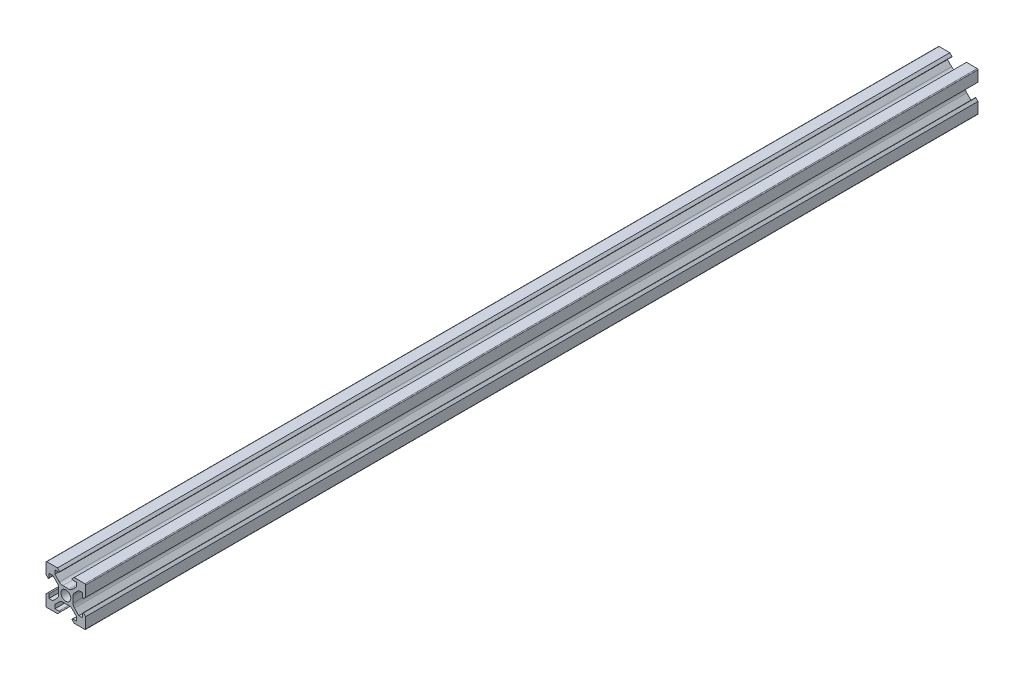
ISO-10303-21;
HEADER;
FILE_DESCRIPTION(('STEP AP214'),'2;1');
FILE_NAME('part.step','',(''),(''),'','','');
FILE_SCHEMA(('AUTOMOTIVE_DESIGN { 1 0 10303 214 1 1 1 1 }'));
ENDSEC;
DATA;
#1=APPLICATION_CONTEXT('core data for automotive mechanical design processes');
#2=APPLICATION_PROTOCOL_DEFINITION('international standard','automotive_design',2000,#1);
#3=PRODUCT_CONTEXT('',#1,'mechanical');
#4=PRODUCT('Part','Part','',(#3));
#5=PRODUCT_RELATED_PRODUCT_CATEGORY('part','',(#4));
#6=PRODUCT_DEFINITION_FORMATION('','',#4);
#7=PRODUCT_DEFINITION_CONTEXT('part definition',#1,'design');
#8=PRODUCT_DEFINITION('design','',#6,#7);
#9=PRODUCT_DEFINITION_SHAPE('','',#8);
#10=(LENGTH_UNIT() NAMED_UNIT(*) SI_UNIT(.MILLI.,.METRE.));
#11=(NAMED_UNIT(*) PLANE_ANGLE_UNIT() SI_UNIT($,.RADIAN.));
#12=(NAMED_UNIT(*) SI_UNIT($,.STERADIAN.) SOLID_ANGLE_UNIT());
#13=UNCERTAINTY_MEASURE_WITH_UNIT(LENGTH_MEASURE(1.E-05),#10,'distance_accuracy_value','');
#14=(GEOMETRIC_REPRESENTATION_CONTEXT(3) GLOBAL_UNCERTAINTY_ASSIGNED_CONTEXT((#13)) GLOBAL_UNIT_ASSIGNED_CONTEXT((#10,
#11,#12)) REPRESENTATION_CONTEXT('',''));
#15=CARTESIAN_POINT('',(0.,0.,0.));
#16=DIRECTION('',(0.,0.,1.));
#17=DIRECTION('',(1.,0.,0.));
#18=AXIS2_PLACEMENT_3D('',#15,#16,#17);
#19=CARTESIAN_POINT('',(-1.50380592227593,6.09999999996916,225.));
#20=DIRECTION('',(0.,0.,1.));
#21=DIRECTION('',(1.,0.,0.));
#22=AXIS2_PLACEMENT_3D('',#19,#20,#21);
#23=PLANE('',#22);
#24=DIRECTION('',(-0.707106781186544,0.707106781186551,0.));
#25=VECTOR('',#24,1.);
#26=CARTESIAN_POINT('',(-5.49999999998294,6.56066017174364,225.));
#27=LINE('',#26,#25);
#28=CARTESIAN_POINT('',(-3.27157287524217,4.33223304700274,225.));
#29=VERTEX_POINT('',#28);
#30=CARTESIAN_POINT('',(-5.49999999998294,6.56066017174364,225.));
#31=VERTEX_POINT('',#30);
#32=EDGE_CURVE('E599',#29,#31,#27,.T.);
#33=ORIENTED_EDGE('',*,*,#32,.T.);
#34=DIRECTION('',(0.,1.,0.));
#35=VECTOR('',#34,1.);
#36=CARTESIAN_POINT('',(-5.49999999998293,8.49999999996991,225.));
#37=LINE('',#36,#35);
#38=CARTESIAN_POINT('',(-5.49999999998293,8.49999999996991,225.));
#39=VERTEX_POINT('',#38);
#40=EDGE_CURVE('E265',#31,#39,#37,.T.);
#41=ORIENTED_EDGE('',*,*,#40,.T.);
#42=DIRECTION('',(1.,0.,0.));
#43=VECTOR('',#42,1.);
#44=CARTESIAN_POINT('',(-5.49999999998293,8.49999999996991,225.));
#45=LINE('',#44,#43);
#46=CARTESIAN_POINT('',(-3.49999999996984,8.4999999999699,225.));
#47=VERTEX_POINT('',#46);
#48=EDGE_CURVE('E782',#39,#47,#45,.T.);
#49=ORIENTED_EDGE('',*,*,#48,.T.);
#50=CARTESIAN_POINT('',(-3.49999999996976,8.8999999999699,225.));
#51=DIRECTION('',(0.,0.,1.));
#52=DIRECTION('',(1.,0.,0.));
#53=AXIS2_PLACEMENT_3D('',#50,#51,#52);
#54=CIRCLE('',#53,0.4);
#55=CARTESIAN_POINT('',(-3.09999999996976,8.8999999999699,225.));
#56=VERTEX_POINT('',#55);
#57=EDGE_CURVE('E801',#47,#56,#54,.T.);
#58=ORIENTED_EDGE('',*,*,#57,.T.);
#59=DIRECTION('',(-0.707106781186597,0.707106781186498,0.));
#60=VECTOR('',#59,1.);
#61=CARTESIAN_POINT('',(-3.09999999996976,8.89999999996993,225.));
#62=LINE('',#61,#60);
#63=CARTESIAN_POINT('',(-4.19999999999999,10.,225.));
#64=VERTEX_POINT('',#63);
#65=EDGE_CURVE('E798',#56,#64,#62,.T.);
#66=ORIENTED_EDGE('',*,*,#65,.T.);
#67=DIRECTION('',(-1.,0.,0.));
#68=VECTOR('',#67,1.);
#69=CARTESIAN_POINT('',(-9.59999999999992,10.0000000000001,225.));
#70=LINE('',#69,#68);
#71=CARTESIAN_POINT('',(-9.59999999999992,10.0000000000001,225.));
#72=VERTEX_POINT('',#71);
#73=EDGE_CURVE('E800',#64,#72,#70,.T.);
#74=ORIENTED_EDGE('',*,*,#73,.T.);
#75=CARTESIAN_POINT('',(-9.59999999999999,9.60000000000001,225.));
#76=DIRECTION('',(0.,0.,1.));
#77=DIRECTION('',(1.,0.,0.));
#78=AXIS2_PLACEMENT_3D('',#75,#76,#77);
#79=CIRCLE('',#78,0.400000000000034);
#80=CARTESIAN_POINT('',(-10.,9.60000000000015,225.));
#81=VERTEX_POINT('',#80);
#82=EDGE_CURVE('E803',#72,#81,#79,.T.);
#83=ORIENTED_EDGE('',*,*,#82,.T.);
#84=DIRECTION('',(0.,-1.,0.));
#85=VECTOR('',#84,1.);
#86=CARTESIAN_POINT('',(-9.99999999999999,9.60000000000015,225.));
#87=LINE('',#86,#85);
#88=CARTESIAN_POINT('',(-9.99999999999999,4.2,225.));
#89=VERTEX_POINT('',#88);
#90=EDGE_CURVE('E809',#81,#89,#87,.T.);
#91=ORIENTED_EDGE('',*,*,#90,.T.);
#92=DIRECTION('',(0.707106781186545,-0.70710678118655,0.));
#93=VECTOR('',#92,1.);
#94=CARTESIAN_POINT('',(-8.89999999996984,3.09999999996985,225.));
#95=LINE('',#94,#93);
#96=CARTESIAN_POINT('',(-8.89999999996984,3.09999999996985,225.));
#97=VERTEX_POINT('',#96);
#98=EDGE_CURVE('E811',#89,#97,#95,.T.);
#99=ORIENTED_EDGE('',*,*,#98,.T.);
#100=CARTESIAN_POINT('',(-8.89999999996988,3.49999999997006,225.));
#101=DIRECTION('',(0.,0.,1.));
#102=DIRECTION('',(-1.,0.,0.));
#103=AXIS2_PLACEMENT_3D('',#100,#101,#102);
#104=CIRCLE('',#103,0.400000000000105);
#105=CARTESIAN_POINT('',(-8.49999999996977,3.49999999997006,225.));
#106=VERTEX_POINT('',#105);
#107=EDGE_CURVE('E813',#97,#106,#104,.T.);
#108=ORIENTED_EDGE('',*,*,#107,.T.);
#109=DIRECTION('',(0.,1.,0.));
#110=VECTOR('',#109,1.);
#111=CARTESIAN_POINT('',(-8.49999999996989,5.49999999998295,225.));
#112=LINE('',#111,#110);
#113=CARTESIAN_POINT('',(-8.49999999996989,5.49999999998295,225.));
#114=VERTEX_POINT('',#113);
#115=EDGE_CURVE('E815',#106,#114,#112,.T.);
#116=ORIENTED_EDGE('',*,*,#115,.T.);
#117=DIRECTION('',(1.,0.,0.));
#118=VECTOR('',#117,1.);
#119=CARTESIAN_POINT('',(-8.49999999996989,5.49999999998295,225.));
#120=LINE('',#119,#118);
#121=CARTESIAN_POINT('',(-6.56066017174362,5.49999999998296,225.));
#122=VERTEX_POINT('',#121);
#123=EDGE_CURVE('E817',#114,#122,#120,.T.);
#124=ORIENTED_EDGE('',*,*,#123,.T.);
#125=DIRECTION('',(0.707106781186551,-0.707106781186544,0.));
#126=VECTOR('',#125,1.);
#127=CARTESIAN_POINT('',(-6.56066017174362,5.49999999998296,225.));
#128=LINE('',#127,#126);
#129=CARTESIAN_POINT('',(-4.33223304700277,3.27157287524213,225.));
#130=VERTEX_POINT('',#129);
#131=EDGE_CURVE('E819',#122,#130,#128,.T.);
#132=ORIENTED_EDGE('',*,*,#131,.T.);
#133=CARTESIAN_POINT('',(-6.09999999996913,1.50380592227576,225.));
#134=DIRECTION('',(0.,0.,-1.));
#135=DIRECTION('',(-1.,0.,0.));
#136=AXIS2_PLACEMENT_3D('',#133,#134,#135);
#137=CIRCLE('',#136,2.5);
#138=CARTESIAN_POINT('',(-3.59999999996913,1.50380592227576,225.));
#139=VERTEX_POINT('',#138);
#140=EDGE_CURVE('E821',#130,#139,#137,.T.);
#141=ORIENTED_EDGE('',*,*,#140,.T.);
#142=DIRECTION('',(0.,-1.,0.));
#143=VECTOR('',#142,1.);
#144=CARTESIAN_POINT('',(-3.59999999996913,1.50380592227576,225.));
#145=LINE('',#144,#143);
#146=CARTESIAN_POINT('',(-3.59999999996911,-1.50380592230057,225.));
#147=VERTEX_POINT('',#146);
#148=EDGE_CURVE('E823',#139,#147,#145,.T.);
#149=ORIENTED_EDGE('',*,*,#148,.T.);
#150=CARTESIAN_POINT('',(-6.09999999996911,-1.50380592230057,225.));
#151=DIRECTION('',(0.,0.,-1.));
#152=DIRECTION('',(1.,0.,0.));
#153=AXIS2_PLACEMENT_3D('',#150,#151,#152);
#154=CIRCLE('',#153,2.50000000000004);
#155=CARTESIAN_POINT('',(-4.33223304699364,-3.2715728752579,225.));
#156=VERTEX_POINT('',#155);
#157=EDGE_CURVE('E825',#147,#156,#154,.T.);
#158=ORIENTED_EDGE('',*,*,#157,.T.);
#159=DIRECTION('',(-0.707106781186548,-0.707106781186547,0.));
#160=VECTOR('',#159,1.);
#161=CARTESIAN_POINT('',(-6.56066017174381,-5.50000000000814,225.));
#162=LINE('',#161,#160);
#163=CARTESIAN_POINT('',(-6.56066017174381,-5.50000000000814,225.));
#164=VERTEX_POINT('',#163);
#165=EDGE_CURVE('E827',#156,#164,#162,.T.);
#166=ORIENTED_EDGE('',*,*,#165,.T.);
#167=DIRECTION('',(-1.,0.,0.));
#168=VECTOR('',#167,1.);
#169=CARTESIAN_POINT('',(-8.49999999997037,-5.50000000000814,225.));
#170=LINE('',#169,#168);
#171=CARTESIAN_POINT('',(-8.49999999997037,-5.50000000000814,225.));
#172=VERTEX_POINT('',#171);
#173=EDGE_CURVE('E829',#164,#172,#170,.T.);
#174=ORIENTED_EDGE('',*,*,#173,.T.);
#175=DIRECTION('',(0.,1.,0.));
#176=VECTOR('',#175,1.);
#177=CARTESIAN_POINT('',(-8.49999999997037,-5.50000000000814,225.));
#178=LINE('',#177,#176);
#179=CARTESIAN_POINT('',(-8.49999999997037,-3.49999999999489,225.));
#180=VERTEX_POINT('',#179);
#181=EDGE_CURVE('E831',#172,#180,#178,.T.);
#182=ORIENTED_EDGE('',*,*,#181,.T.);
#183=CARTESIAN_POINT('',(-8.89999999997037,-3.49999999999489,225.));
#184=DIRECTION('',(0.,0.,1.));
#185=DIRECTION('',(1.,0.,0.));
#186=AXIS2_PLACEMENT_3D('',#183,#184,#185);
#187=CIRCLE('',#186,0.400000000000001);
#188=CARTESIAN_POINT('',(-8.8999999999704,-3.09999999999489,225.));
#189=VERTEX_POINT('',#188);
#190=EDGE_CURVE('E833',#180,#189,#187,.T.);
#191=ORIENTED_EDGE('',*,*,#190,.T.);
#192=DIRECTION('',(-0.707106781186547,-0.707106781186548,0.));
#193=VECTOR('',#192,1.);
#194=CARTESIAN_POINT('',(-8.8999999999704,-3.09999999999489,225.));
#195=LINE('',#194,#193);
#196=CARTESIAN_POINT('',(-10.0000000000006,-4.20000000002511,225.));
#197=VERTEX_POINT('',#196);
#198=EDGE_CURVE('E835',#189,#197,#195,.T.);
#199=ORIENTED_EDGE('',*,*,#198,.T.);
#200=DIRECTION('',(0.,-1.,0.));
#201=VECTOR('',#200,1.);
#202=CARTESIAN_POINT('',(-10.0000000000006,-9.60000000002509,225.));
#203=LINE('',#202,#201);
#204=CARTESIAN_POINT('',(-10.0000000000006,-9.60000000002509,225.));
#205=VERTEX_POINT('',#204);
#206=EDGE_CURVE('E837',#197,#205,#203,.T.);
#207=ORIENTED_EDGE('',*,*,#206,.T.);
#208=CARTESIAN_POINT('',(-9.60000000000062,-9.60000000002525,225.));
#209=DIRECTION('',(0.,0.,1.));
#210=DIRECTION('',(1.,0.,0.));
#211=AXIS2_PLACEMENT_3D('',#208,#209,#210);
#212=CIRCLE('',#211,0.4);
#213=CARTESIAN_POINT('',(-9.60000000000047,-10.0000000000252,225.));
#214=VERTEX_POINT('',#213);
#215=EDGE_CURVE('E839',#205,#214,#212,.T.);
#216=ORIENTED_EDGE('',*,*,#215,.T.);
#217=DIRECTION('',(1.,0.,0.));
#218=VECTOR('',#217,1.);
#219=CARTESIAN_POINT('',(-9.60000000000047,-10.0000000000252,225.));
#220=LINE('',#219,#218);
#221=CARTESIAN_POINT('',(-4.20000000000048,-10.0000000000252,225.));
#222=VERTEX_POINT('',#221);
#223=EDGE_CURVE('E841',#214,#222,#220,.T.);
#224=ORIENTED_EDGE('',*,*,#223,.T.);
#225=DIRECTION('',(0.707106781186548,0.707106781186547,0.));
#226=VECTOR('',#225,1.);
#227=CARTESIAN_POINT('',(-3.09999999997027,-8.89999999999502,225.));
#228=LINE('',#227,#226);
#229=CARTESIAN_POINT('',(-3.09999999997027,-8.89999999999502,225.));
#230=VERTEX_POINT('',#229);
#231=EDGE_CURVE('E843',#222,#230,#228,.T.);
#232=ORIENTED_EDGE('',*,*,#231,.T.);
#233=CARTESIAN_POINT('',(-3.49999999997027,-8.89999999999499,225.));
#234=DIRECTION('',(0.,0.,1.));
#235=DIRECTION('',(-1.,0.,0.));
#236=AXIS2_PLACEMENT_3D('',#233,#234,#235);
#237=CIRCLE('',#236,0.400000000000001);
#238=CARTESIAN_POINT('',(-3.49999999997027,-8.49999999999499,225.));
#239=VERTEX_POINT('',#238);
#240=EDGE_CURVE('E845',#230,#239,#237,.T.);
#241=ORIENTED_EDGE('',*,*,#240,.T.);
#242=DIRECTION('',(-1.,0.,0.));
#243=VECTOR('',#242,1.);
#244=CARTESIAN_POINT('',(-5.49999999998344,-8.49999999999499,225.));
#245=LINE('',#244,#243);
#246=CARTESIAN_POINT('',(-5.49999999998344,-8.49999999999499,225.));
#247=VERTEX_POINT('',#246);
#248=EDGE_CURVE('E847',#239,#247,#245,.T.);
#249=ORIENTED_EDGE('',*,*,#248,.T.);
#250=DIRECTION('',(0.,1.,0.));
#251=VECTOR('',#250,1.);
#252=CARTESIAN_POINT('',(-5.49999999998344,-8.49999999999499,225.));
#253=LINE('',#252,#251);
#254=CARTESIAN_POINT('',(-5.49999999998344,-6.56066017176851,225.));
#255=VERTEX_POINT('',#254);
#256=EDGE_CURVE('E849',#247,#255,#253,.T.);
#257=ORIENTED_EDGE('',*,*,#256,.T.);
#258=DIRECTION('',(0.707106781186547,0.707106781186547,0.));
#259=VECTOR('',#258,1.);
#260=CARTESIAN_POINT('',(-5.49999999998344,-6.56066017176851,225.));
#261=LINE('',#260,#259);
#262=CARTESIAN_POINT('',(-3.27157287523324,-4.33223304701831,225.));
#263=VERTEX_POINT('',#262);
#264=EDGE_CURVE('E851',#255,#263,#261,.T.);
#265=ORIENTED_EDGE('',*,*,#264,.T.);
#266=CARTESIAN_POINT('',(-1.50380592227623,-6.09999999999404,225.));
#267=DIRECTION('',(0.,0.,-1.));
#268=DIRECTION('',(-1.,0.,0.));
#269=AXIS2_PLACEMENT_3D('',#266,#267,#268);
#270=CIRCLE('',#269,2.5);
#271=CARTESIAN_POINT('',(-1.50380592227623,-3.59999999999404,225.));
#272=VERTEX_POINT('',#271);
#273=EDGE_CURVE('E853',#263,#272,#270,.T.);
#274=ORIENTED_EDGE('',*,*,#273,.T.);
#275=DIRECTION('',(1.,0.,0.));
#276=VECTOR('',#275,1.);
#277=CARTESIAN_POINT('',(-1.50380592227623,-3.59999999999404,225.));
#278=LINE('',#277,#276);
#279=CARTESIAN_POINT('',(1.50380592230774,-3.59999999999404,225.));
#280=VERTEX_POINT('',#279);
#281=EDGE_CURVE('E855',#272,#280,#278,.T.);
#282=ORIENTED_EDGE('',*,*,#281,.T.);
#283=CARTESIAN_POINT('',(1.50380592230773,-6.09999999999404,225.));
#284=DIRECTION('',(0.,0.,-1.));
#285=DIRECTION('',(1.,0.,0.));
#286=AXIS2_PLACEMENT_3D('',#283,#284,#285);
#287=CIRCLE('',#286,2.5);
#288=CARTESIAN_POINT('',(3.27157287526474,-4.33223304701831,225.));
#289=VERTEX_POINT('',#288);
#290=EDGE_CURVE('E857',#280,#289,#287,.T.);
#291=ORIENTED_EDGE('',*,*,#290,.T.);
#292=DIRECTION('',(0.707106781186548,-0.707106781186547,0.));
#293=VECTOR('',#292,1.);
#294=CARTESIAN_POINT('',(5.50000000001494,-6.56066017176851,225.));
#295=LINE('',#294,#293);
#296=CARTESIAN_POINT('',(5.50000000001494,-6.56066017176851,225.));
#297=VERTEX_POINT('',#296);
#298=EDGE_CURVE('E859',#289,#297,#295,.T.);
#299=ORIENTED_EDGE('',*,*,#298,.T.);
#300=DIRECTION('',(0.,-1.,0.));
#301=VECTOR('',#300,1.);
#302=CARTESIAN_POINT('',(5.50000000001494,-8.49999999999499,225.));
#303=LINE('',#302,#301);
#304=CARTESIAN_POINT('',(5.50000000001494,-8.49999999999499,225.));
#305=VERTEX_POINT('',#304);
#306=EDGE_CURVE('E861',#297,#305,#303,.T.);
#307=ORIENTED_EDGE('',*,*,#306,.T.);
#308=DIRECTION('',(-1.,0.,0.));
#309=VECTOR('',#308,1.);
#310=CARTESIAN_POINT('',(5.50000000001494,-8.49999999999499,225.));
#311=LINE('',#310,#309);
#312=CARTESIAN_POINT('',(3.50000000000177,-8.49999999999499,225.));
#313=VERTEX_POINT('',#312);
#314=EDGE_CURVE('E863',#305,#313,#311,.T.);
#315=ORIENTED_EDGE('',*,*,#314,.T.);
#316=CARTESIAN_POINT('',(3.50000000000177,-8.89999999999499,225.));
#317=DIRECTION('',(0.,0.,1.));
#318=DIRECTION('',(1.,0.,0.));
#319=AXIS2_PLACEMENT_3D('',#316,#317,#318);
#320=CIRCLE('',#319,0.400000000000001);
#321=CARTESIAN_POINT('',(3.10000000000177,-8.89999999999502,225.));
#322=VERTEX_POINT('',#321);
#323=EDGE_CURVE('E865',#313,#322,#320,.T.);
#324=ORIENTED_EDGE('',*,*,#323,.T.);
#325=DIRECTION('',(0.707106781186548,-0.707106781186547,0.));
#326=VECTOR('',#325,1.);
#327=CARTESIAN_POINT('',(3.10000000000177,-8.89999999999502,225.));
#328=LINE('',#327,#326);
#329=CARTESIAN_POINT('',(4.20000000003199,-10.0000000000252,225.));
#330=VERTEX_POINT('',#329);
#331=EDGE_CURVE('E867',#322,#330,#328,.T.);
#332=ORIENTED_EDGE('',*,*,#331,.T.);
#333=DIRECTION('',(1.,0.,0.));
#334=VECTOR('',#333,1.);
#335=CARTESIAN_POINT('',(9.60000000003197,-10.0000000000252,225.));
#336=LINE('',#335,#334);
#337=CARTESIAN_POINT('',(9.60000000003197,-10.0000000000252,225.));
#338=VERTEX_POINT('',#337);
#339=EDGE_CURVE('E869',#330,#338,#336,.T.);
#340=ORIENTED_EDGE('',*,*,#339,.T.);
#341=CARTESIAN_POINT('',(9.60000000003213,-9.60000000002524,225.));
#342=DIRECTION('',(0.,0.,1.));
#343=DIRECTION('',(-1.,0.,0.));
#344=AXIS2_PLACEMENT_3D('',#341,#342,#343);
#345=CIRCLE('',#344,0.4);
#346=CARTESIAN_POINT('',(10.0000000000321,-9.60000000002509,225.));
#347=VERTEX_POINT('',#346);
#348=EDGE_CURVE('E871',#338,#347,#345,.T.);
#349=ORIENTED_EDGE('',*,*,#348,.T.);
#350=DIRECTION('',(0.,1.,0.));
#351=VECTOR('',#350,1.);
#352=CARTESIAN_POINT('',(10.0000000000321,-9.60000000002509,225.));
#353=LINE('',#352,#351);
#354=CARTESIAN_POINT('',(10.0000000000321,-4.20000000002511,225.));
#355=VERTEX_POINT('',#354);
#356=EDGE_CURVE('E873',#347,#355,#353,.T.);
#357=ORIENTED_EDGE('',*,*,#356,.T.);
#358=DIRECTION('',(-0.707106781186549,0.707106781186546,0.));
#359=VECTOR('',#358,1.);
#360=CARTESIAN_POINT('',(8.9000000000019,-3.09999999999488,225.));
#361=LINE('',#360,#359);
#362=CARTESIAN_POINT('',(8.9000000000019,-3.09999999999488,225.));
#363=VERTEX_POINT('',#362);
#364=EDGE_CURVE('E875',#355,#363,#361,.T.);
#365=ORIENTED_EDGE('',*,*,#364,.T.);
#366=CARTESIAN_POINT('',(8.90000000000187,-3.49999999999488,225.));
#367=DIRECTION('',(0.,0.,1.));
#368=DIRECTION('',(-1.,0.,0.));
#369=AXIS2_PLACEMENT_3D('',#366,#367,#368);
#370=CIRCLE('',#369,0.400000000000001);
#371=CARTESIAN_POINT('',(8.50000000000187,-3.49999999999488,225.));
#372=VERTEX_POINT('',#371);
#373=EDGE_CURVE('E877',#363,#372,#370,.T.);
#374=ORIENTED_EDGE('',*,*,#373,.T.);
#375=DIRECTION('',(0.,-1.,0.));
#376=VECTOR('',#375,1.);
#377=CARTESIAN_POINT('',(8.50000000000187,-5.50000000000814,225.));
#378=LINE('',#377,#376);
#379=CARTESIAN_POINT('',(8.50000000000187,-5.50000000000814,225.));
#380=VERTEX_POINT('',#379);
#381=EDGE_CURVE('E879',#372,#380,#378,.T.);
#382=ORIENTED_EDGE('',*,*,#381,.T.);
#383=DIRECTION('',(-1.,0.,0.));
#384=VECTOR('',#383,1.);
#385=CARTESIAN_POINT('',(8.50000000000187,-5.50000000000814,225.));
#386=LINE('',#385,#384);
#387=CARTESIAN_POINT('',(6.56066017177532,-5.50000000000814,225.));
#388=VERTEX_POINT('',#387);
#389=EDGE_CURVE('E881',#380,#388,#386,.T.);
#390=ORIENTED_EDGE('',*,*,#389,.T.);
#391=DIRECTION('',(-0.707106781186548,0.707106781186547,0.));
#392=VECTOR('',#391,1.);
#393=CARTESIAN_POINT('',(6.56066017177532,-5.50000000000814,225.));
#394=LINE('',#393,#392);
#395=CARTESIAN_POINT('',(4.33223304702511,-3.27157287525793,225.));
#396=VERTEX_POINT('',#395);
#397=EDGE_CURVE('E883',#388,#396,#394,.T.);
#398=ORIENTED_EDGE('',*,*,#397,.T.);
#399=CARTESIAN_POINT('',(6.10000000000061,-1.50380592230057,225.));
#400=DIRECTION('',(0.,0.,-1.));
#401=DIRECTION('',(-1.,0.,0.));
#402=AXIS2_PLACEMENT_3D('',#399,#400,#401);
#403=CIRCLE('',#402,2.50000000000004);
#404=CARTESIAN_POINT('',(3.60000000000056,-1.50380592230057,225.));
#405=VERTEX_POINT('',#404);
#406=EDGE_CURVE('E885',#396,#405,#403,.T.);
#407=ORIENTED_EDGE('',*,*,#406,.T.);
#408=DIRECTION('',(0.,1.,0.));
#409=VECTOR('',#408,1.);
#410=CARTESIAN_POINT('',(3.60000000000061,-1.50380592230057,225.));
#411=LINE('',#410,#409);
#412=CARTESIAN_POINT('',(3.60000000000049,1.50380592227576,225.));
#413=VERTEX_POINT('',#412);
#414=EDGE_CURVE('E887',#405,#413,#411,.T.);
#415=ORIENTED_EDGE('',*,*,#414,.T.);
#416=CARTESIAN_POINT('',(6.10000000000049,1.50380592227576,225.));
#417=DIRECTION('',(0.,0.,-1.));
#418=DIRECTION('',(1.,0.,0.));
#419=AXIS2_PLACEMENT_3D('',#416,#417,#418);
#420=CIRCLE('',#419,2.5);
#421=CARTESIAN_POINT('',(4.33223304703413,3.27157287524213,225.));
#422=VERTEX_POINT('',#421);
#423=EDGE_CURVE('E889',#413,#422,#420,.T.);
#424=ORIENTED_EDGE('',*,*,#423,.T.);
#425=DIRECTION('',(0.70710678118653,0.707106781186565,0.));
#426=VECTOR('',#425,1.);
#427=CARTESIAN_POINT('',(6.56066017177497,5.49999999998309,225.));
#428=LINE('',#427,#426);
#429=CARTESIAN_POINT('',(6.56066017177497,5.49999999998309,225.));
#430=VERTEX_POINT('',#429);
#431=EDGE_CURVE('E891',#422,#430,#428,.T.);
#432=ORIENTED_EDGE('',*,*,#431,.T.);
#433=DIRECTION('',(1.,0.,0.));
#434=VECTOR('',#433,1.);
#435=CARTESIAN_POINT('',(8.50000000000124,5.49999999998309,225.));
#436=LINE('',#435,#434);
#437=CARTESIAN_POINT('',(8.50000000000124,5.49999999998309,225.));
#438=VERTEX_POINT('',#437);
#439=EDGE_CURVE('E893',#430,#438,#436,.T.);
#440=ORIENTED_EDGE('',*,*,#439,.T.);
#441=DIRECTION('',(0.,-1.,0.));
#442=VECTOR('',#441,1.);
#443=CARTESIAN_POINT('',(8.50000000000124,5.49999999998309,225.));
#444=LINE('',#443,#442);
#445=CARTESIAN_POINT('',(8.50000000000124,3.49999999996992,225.));
#446=VERTEX_POINT('',#445);
#447=EDGE_CURVE('E895',#438,#446,#444,.T.);
#448=ORIENTED_EDGE('',*,*,#447,.T.);
#449=CARTESIAN_POINT('',(8.90000000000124,3.49999999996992,225.));
#450=DIRECTION('',(0.,0.,1.));
#451=DIRECTION('',(1.,0.,0.));
#452=AXIS2_PLACEMENT_3D('',#449,#450,#451);
#453=CIRCLE('',#452,0.399999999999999);
#454=CARTESIAN_POINT('',(8.90000000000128,3.09999999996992,225.));
#455=VERTEX_POINT('',#454);
#456=EDGE_CURVE('E897',#446,#455,#453,.T.);
#457=ORIENTED_EDGE('',*,*,#456,.T.);
#458=DIRECTION('',(0.707106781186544,0.707106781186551,0.));
#459=VECTOR('',#458,1.);
#460=CARTESIAN_POINT('',(8.90000000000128,3.09999999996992,225.));
#461=LINE('',#460,#459);
#462=CARTESIAN_POINT('',(10.0000000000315,4.20000000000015,225.));
#463=VERTEX_POINT('',#462);
#464=EDGE_CURVE('E899',#455,#463,#461,.T.);
#465=ORIENTED_EDGE('',*,*,#464,.T.);
#466=DIRECTION('',(0.,1.,0.));
#467=VECTOR('',#466,1.);
#468=CARTESIAN_POINT('',(10.0000000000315,9.60000000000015,225.));
#469=LINE('',#468,#467);
#470=CARTESIAN_POINT('',(10.0000000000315,9.60000000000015,225.));
#471=VERTEX_POINT('',#470);
#472=EDGE_CURVE('E901',#463,#471,#469,.T.);
#473=ORIENTED_EDGE('',*,*,#472,.T.);
#474=CARTESIAN_POINT('',(9.60000000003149,9.60000000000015,225.));
#475=DIRECTION('',(0.,0.,1.));
#476=DIRECTION('',(-1.,0.,0.));
#477=AXIS2_PLACEMENT_3D('',#474,#475,#476);
#478=CIRCLE('',#477,0.400000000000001);
#479=CARTESIAN_POINT('',(9.60000000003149,10.0000000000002,225.));
#480=VERTEX_POINT('',#479);
#481=EDGE_CURVE('E903',#471,#480,#478,.T.);
#482=ORIENTED_EDGE('',*,*,#481,.T.);
#483=DIRECTION('',(-1.,0.,0.));
#484=VECTOR('',#483,1.);
#485=CARTESIAN_POINT('',(9.60000000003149,10.0000000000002,225.));
#486=LINE('',#485,#484);
#487=CARTESIAN_POINT('',(4.20000000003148,10.0000000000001,225.));
#488=VERTEX_POINT('',#487);
#489=EDGE_CURVE('E905',#480,#488,#486,.T.);
#490=ORIENTED_EDGE('',*,*,#489,.T.);
#491=DIRECTION('',(-0.707106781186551,-0.707106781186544,0.));
#492=VECTOR('',#491,1.);
#493=CARTESIAN_POINT('',(3.10000000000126,8.89999999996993,225.));
#494=LINE('',#493,#492);
#495=CARTESIAN_POINT('',(3.10000000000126,8.89999999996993,225.));
#496=VERTEX_POINT('',#495);
#497=EDGE_CURVE('E907',#488,#496,#494,.T.);
#498=ORIENTED_EDGE('',*,*,#497,.T.);
#499=CARTESIAN_POINT('',(3.50000000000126,8.89999999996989,225.));
#500=DIRECTION('',(0.,0.,1.));
#501=DIRECTION('',(-1.,0.,0.));
#502=AXIS2_PLACEMENT_3D('',#499,#500,#501);
#503=CIRCLE('',#502,0.4);
#504=CARTESIAN_POINT('',(3.50000000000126,8.4999999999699,225.));
#505=VERTEX_POINT('',#504);
#506=EDGE_CURVE('E909',#496,#505,#503,.T.);
#507=ORIENTED_EDGE('',*,*,#506,.T.);
#508=DIRECTION('',(1.,0.,0.));
#509=VECTOR('',#508,1.);
#510=CARTESIAN_POINT('',(5.50000000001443,8.4999999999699,225.));
#511=LINE('',#510,#509);
#512=CARTESIAN_POINT('',(5.50000000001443,8.4999999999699,225.));
#513=VERTEX_POINT('',#512);
#514=EDGE_CURVE('E911',#505,#513,#511,.T.);
#515=ORIENTED_EDGE('',*,*,#514,.T.);
#516=DIRECTION('',(0.,-1.,0.));
#517=VECTOR('',#516,1.);
#518=CARTESIAN_POINT('',(5.50000000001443,8.4999999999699,225.));
#519=LINE('',#518,#517);
#520=CARTESIAN_POINT('',(5.50000000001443,6.56066017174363,225.));
#521=VERTEX_POINT('',#520);
#522=EDGE_CURVE('E913',#513,#521,#519,.T.);
#523=ORIENTED_EDGE('',*,*,#522,.T.);
#524=DIRECTION('',(-0.707106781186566,-0.707106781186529,0.));
#525=VECTOR('',#524,1.);
#526=CARTESIAN_POINT('',(5.50000000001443,6.56066017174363,225.));
#527=LINE('',#526,#525);
#528=CARTESIAN_POINT('',(3.27157287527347,4.33223304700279,225.));
#529=VERTEX_POINT('',#528);
#530=EDGE_CURVE('E452',#521,#529,#527,.T.);
#531=ORIENTED_EDGE('',*,*,#530,.T.);
#532=CARTESIAN_POINT('',(1.5038059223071,6.09999999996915,225.));
#533=DIRECTION('',(0.,0.,-1.));
#534=DIRECTION('',(-1.,0.,0.));
#535=AXIS2_PLACEMENT_3D('',#532,#533,#534);
#536=CIRCLE('',#535,2.5);
#537=CARTESIAN_POINT('',(1.5038059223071,3.59999999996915,225.));
#538=VERTEX_POINT('',#537);
#539=EDGE_CURVE('E446',#529,#538,#536,.T.);
#540=ORIENTED_EDGE('',*,*,#539,.T.);
#541=DIRECTION('',(-1.,0.,0.));
#542=VECTOR('',#541,1.);
#543=CARTESIAN_POINT('',(-1.50380592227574,3.59999999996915,225.));
#544=LINE('',#543,#542);
#545=CARTESIAN_POINT('',(-1.50380592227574,3.59999999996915,225.));
#546=VERTEX_POINT('',#545);
#547=EDGE_CURVE('E450',#538,#546,#544,.T.);
#548=ORIENTED_EDGE('',*,*,#547,.T.);
#549=CARTESIAN_POINT('',(-1.50380592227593,6.09999999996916,225.));
#550=DIRECTION('',(0.,0.,-1.));
#551=DIRECTION('',(1.,0.,0.));
#552=AXIS2_PLACEMENT_3D('',#549,#550,#551);
#553=CIRCLE('',#552,2.49999999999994);
#554=EDGE_CURVE('E54',#546,#29,#553,.T.);
#555=ORIENTED_EDGE('',*,*,#554,.T.);
#556=EDGE_LOOP('',(#33,#41,#49,#58,#66,#74,#83,#91,#99,#108,#116,#124,#132,#141,#149,#158,#166,
#174,#182,#191,#199,#207,#216,#224,#232,#241,#249,#257,#265,#274,#282,#291,#299,#307,#315,#324,
#332,#340,#349,#357,#365,#374,#382,#390,#398,#407,#415,#424,#432,#440,#448,#457,#465,#473,#482,
#490,#498,#507,#515,#523,#531,#540,#548,#555));
#557=FACE_BOUND('',#556,.T.);
#558=CARTESIAN_POINT('',(1.57495544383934E-11,-1.55890925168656E-11,225.));
#559=DIRECTION('',(0.,0.,1.));
#560=DIRECTION('',(1.,0.,0.));
#561=AXIS2_PLACEMENT_3D('',#558,#559,#560);
#562=CIRCLE('',#561,2.50000000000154);
#563=CARTESIAN_POINT('',(2.50000000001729,-1.55890925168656E-11,225.));
#564=VERTEX_POINT('',#563);
#565=EDGE_CURVE('E474',#564,#564,#562,.T.);
#566=ORIENTED_EDGE('',*,*,#565,.F.);
#567=EDGE_LOOP('',(#566));
#568=FACE_BOUND('',#567,.T.);
#569=ADVANCED_FACE('F37',(#557,#568),#23,.T.);
#570=CARTESIAN_POINT('',(-1.50380592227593,6.09999999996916,-225.));
#571=DIRECTION('',(0.,0.,1.));
#572=DIRECTION('',(1.,0.,0.));
#573=AXIS2_PLACEMENT_3D('',#570,#571,#572);
#574=PLANE('',#573);
#575=DIRECTION('',(-0.707106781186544,0.707106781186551,0.));
#576=VECTOR('',#575,1.);
#577=CARTESIAN_POINT('',(-5.49999999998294,6.56066017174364,-225.));
#578=LINE('',#577,#576);
#579=CARTESIAN_POINT('',(-3.27157287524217,4.33223304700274,-225.));
#580=VERTEX_POINT('',#579);
#581=CARTESIAN_POINT('',(-5.49999999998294,6.56066017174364,-225.));
#582=VERTEX_POINT('',#581);
#583=EDGE_CURVE('E470',#580,#582,#578,.T.);
#584=ORIENTED_EDGE('',*,*,#583,.F.);
#585=CARTESIAN_POINT('',(-1.50380592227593,6.09999999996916,-225.));
#586=DIRECTION('',(0.,0.,-1.));
#587=DIRECTION('',(1.,0.,0.));
#588=AXIS2_PLACEMENT_3D('',#585,#586,#587);
#589=CIRCLE('',#588,2.49999999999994);
#590=CARTESIAN_POINT('',(-1.50380592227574,3.59999999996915,-225.));
#591=VERTEX_POINT('',#590);
#592=EDGE_CURVE('E257',#591,#580,#589,.T.);
#593=ORIENTED_EDGE('',*,*,#592,.F.);
#594=DIRECTION('',(-1.,0.,0.));
#595=VECTOR('',#594,1.);
#596=CARTESIAN_POINT('',(-1.50380592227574,3.59999999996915,-225.));
#597=LINE('',#596,#595);
#598=CARTESIAN_POINT('',(1.5038059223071,3.59999999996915,-225.));
#599=VERTEX_POINT('',#598);
#600=EDGE_CURVE('E251',#599,#591,#597,.T.);
#601=ORIENTED_EDGE('',*,*,#600,.F.);
#602=CARTESIAN_POINT('',(1.5038059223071,6.09999999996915,-225.));
#603=DIRECTION('',(0.,0.,-1.));
#604=DIRECTION('',(-1.,0.,0.));
#605=AXIS2_PLACEMENT_3D('',#602,#603,#604);
#606=CIRCLE('',#605,2.5);
#607=CARTESIAN_POINT('',(3.27157287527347,4.33223304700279,-225.));
#608=VERTEX_POINT('',#607);
#609=EDGE_CURVE('E460',#608,#599,#606,.T.);
#610=ORIENTED_EDGE('',*,*,#609,.F.);
#611=DIRECTION('',(-0.707106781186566,-0.707106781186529,0.));
#612=VECTOR('',#611,1.);
#613=CARTESIAN_POINT('',(5.50000000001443,6.56066017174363,-225.));
#614=LINE('',#613,#612);
#615=CARTESIAN_POINT('',(5.50000000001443,6.56066017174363,-225.));
#616=VERTEX_POINT('',#615);
#617=EDGE_CURVE('E594',#616,#608,#614,.T.);
#618=ORIENTED_EDGE('',*,*,#617,.F.);
#619=DIRECTION('',(0.,-1.,0.));
#620=VECTOR('',#619,1.);
#621=CARTESIAN_POINT('',(5.50000000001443,8.4999999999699,-225.));
#622=LINE('',#621,#620);
#623=CARTESIAN_POINT('',(5.50000000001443,8.4999999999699,-225.));
#624=VERTEX_POINT('',#623);
#625=EDGE_CURVE('E592',#624,#616,#622,.T.);
#626=ORIENTED_EDGE('',*,*,#625,.F.);
#627=DIRECTION('',(1.,0.,0.));
#628=VECTOR('',#627,1.);
#629=CARTESIAN_POINT('',(5.50000000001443,8.4999999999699,-225.));
#630=LINE('',#629,#628);
#631=CARTESIAN_POINT('',(3.50000000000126,8.4999999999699,-225.));
#632=VERTEX_POINT('',#631);
#633=EDGE_CURVE('E590',#632,#624,#630,.T.);
#634=ORIENTED_EDGE('',*,*,#633,.F.);
#635=CARTESIAN_POINT('',(3.50000000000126,8.89999999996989,-225.));
#636=DIRECTION('',(0.,0.,1.));
#637=DIRECTION('',(-1.,0.,0.));
#638=AXIS2_PLACEMENT_3D('',#635,#636,#637);
#639=CIRCLE('',#638,0.4);
#640=CARTESIAN_POINT('',(3.10000000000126,8.89999999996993,-225.));
#641=VERTEX_POINT('',#640);
#642=EDGE_CURVE('E588',#641,#632,#639,.T.);
#643=ORIENTED_EDGE('',*,*,#642,.F.);
#644=DIRECTION('',(-0.707106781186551,-0.707106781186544,0.));
#645=VECTOR('',#644,1.);
#646=CARTESIAN_POINT('',(3.10000000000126,8.89999999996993,-225.));
#647=LINE('',#646,#645);
#648=CARTESIAN_POINT('',(4.20000000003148,10.0000000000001,-225.));
#649=VERTEX_POINT('',#648);
#650=EDGE_CURVE('E586',#649,#641,#647,.T.);
#651=ORIENTED_EDGE('',*,*,#650,.F.);
#652=DIRECTION('',(-1.,0.,0.));
#653=VECTOR('',#652,1.);
#654=CARTESIAN_POINT('',(9.60000000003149,10.0000000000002,-225.));
#655=LINE('',#654,#653);
#656=CARTESIAN_POINT('',(9.60000000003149,10.0000000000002,-225.));
#657=VERTEX_POINT('',#656);
#658=EDGE_CURVE('E584',#657,#649,#655,.T.);
#659=ORIENTED_EDGE('',*,*,#658,.F.);
#660=CARTESIAN_POINT('',(9.60000000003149,9.60000000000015,-225.));
#661=DIRECTION('',(0.,0.,1.));
#662=DIRECTION('',(-1.,0.,0.));
#663=AXIS2_PLACEMENT_3D('',#660,#661,#662);
#664=CIRCLE('',#663,0.400000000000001);
#665=CARTESIAN_POINT('',(10.0000000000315,9.60000000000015,-225.));
#666=VERTEX_POINT('',#665);
#667=EDGE_CURVE('E582',#666,#657,#664,.T.);
#668=ORIENTED_EDGE('',*,*,#667,.F.);
#669=DIRECTION('',(0.,1.,0.));
#670=VECTOR('',#669,1.);
#671=CARTESIAN_POINT('',(10.0000000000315,9.60000000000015,-225.));
#672=LINE('',#671,#670);
#673=CARTESIAN_POINT('',(10.0000000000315,4.20000000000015,-225.));
#674=VERTEX_POINT('',#673);
#675=EDGE_CURVE('E580',#674,#666,#672,.T.);
#676=ORIENTED_EDGE('',*,*,#675,.F.);
#677=DIRECTION('',(0.707106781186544,0.707106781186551,0.));
#678=VECTOR('',#677,1.);
#679=CARTESIAN_POINT('',(8.90000000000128,3.09999999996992,-225.));
#680=LINE('',#679,#678);
#681=CARTESIAN_POINT('',(8.90000000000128,3.09999999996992,-225.));
#682=VERTEX_POINT('',#681);
#683=EDGE_CURVE('E578',#682,#674,#680,.T.);
#684=ORIENTED_EDGE('',*,*,#683,.F.);
#685=CARTESIAN_POINT('',(8.90000000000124,3.49999999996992,-225.));
#686=DIRECTION('',(0.,0.,1.));
#687=DIRECTION('',(1.,0.,0.));
#688=AXIS2_PLACEMENT_3D('',#685,#686,#687);
#689=CIRCLE('',#688,0.399999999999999);
#690=CARTESIAN_POINT('',(8.50000000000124,3.49999999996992,-225.));
#691=VERTEX_POINT('',#690);
#692=EDGE_CURVE('E576',#691,#682,#689,.T.);
#693=ORIENTED_EDGE('',*,*,#692,.F.);
#694=DIRECTION('',(0.,-1.,0.));
#695=VECTOR('',#694,1.);
#696=CARTESIAN_POINT('',(8.50000000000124,5.49999999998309,-225.));
#697=LINE('',#696,#695);
#698=CARTESIAN_POINT('',(8.50000000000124,5.49999999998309,-225.));
#699=VERTEX_POINT('',#698);
#700=EDGE_CURVE('E574',#699,#691,#697,.T.);
#701=ORIENTED_EDGE('',*,*,#700,.F.);
#702=DIRECTION('',(1.,0.,0.));
#703=VECTOR('',#702,1.);
#704=CARTESIAN_POINT('',(8.50000000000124,5.49999999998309,-225.));
#705=LINE('',#704,#703);
#706=CARTESIAN_POINT('',(6.56066017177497,5.49999999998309,-225.));
#707=VERTEX_POINT('',#706);
#708=EDGE_CURVE('E572',#707,#699,#705,.T.);
#709=ORIENTED_EDGE('',*,*,#708,.F.);
#710=DIRECTION('',(0.70710678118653,0.707106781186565,0.));
#711=VECTOR('',#710,1.);
#712=CARTESIAN_POINT('',(6.56066017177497,5.49999999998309,-225.));
#713=LINE('',#712,#711);
#714=CARTESIAN_POINT('',(4.33223304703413,3.27157287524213,-225.));
#715=VERTEX_POINT('',#714);
#716=EDGE_CURVE('E570',#715,#707,#713,.T.);
#717=ORIENTED_EDGE('',*,*,#716,.F.);
#718=CARTESIAN_POINT('',(6.10000000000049,1.50380592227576,-225.));
#719=DIRECTION('',(0.,0.,-1.));
#720=DIRECTION('',(1.,0.,0.));
#721=AXIS2_PLACEMENT_3D('',#718,#719,#720);
#722=CIRCLE('',#721,2.5);
#723=CARTESIAN_POINT('',(3.60000000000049,1.50380592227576,-225.));
#724=VERTEX_POINT('',#723);
#725=EDGE_CURVE('E568',#724,#715,#722,.T.);
#726=ORIENTED_EDGE('',*,*,#725,.F.);
#727=DIRECTION('',(0.,1.,0.));
#728=VECTOR('',#727,1.);
#729=CARTESIAN_POINT('',(3.60000000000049,1.50380592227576,-225.));
#730=LINE('',#729,#728);
#731=CARTESIAN_POINT('',(3.60000000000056,-1.50380592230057,-225.));
#732=VERTEX_POINT('',#731);
#733=EDGE_CURVE('E566',#732,#724,#730,.T.);
#734=ORIENTED_EDGE('',*,*,#733,.F.);
#735=CARTESIAN_POINT('',(6.10000000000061,-1.50380592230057,-225.));
#736=DIRECTION('',(0.,0.,-1.));
#737=DIRECTION('',(-1.,0.,0.));
#738=AXIS2_PLACEMENT_3D('',#735,#736,#737);
#739=CIRCLE('',#738,2.50000000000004);
#740=CARTESIAN_POINT('',(4.33223304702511,-3.27157287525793,-225.));
#741=VERTEX_POINT('',#740);
#742=EDGE_CURVE('E563',#741,#732,#739,.T.);
#743=ORIENTED_EDGE('',*,*,#742,.F.);
#744=DIRECTION('',(-0.707106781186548,0.707106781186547,0.));
#745=VECTOR('',#744,1.);
#746=CARTESIAN_POINT('',(6.56066017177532,-5.50000000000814,-225.));
#747=LINE('',#746,#745);
#748=CARTESIAN_POINT('',(6.56066017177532,-5.50000000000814,-225.));
#749=VERTEX_POINT('',#748);
#750=EDGE_CURVE('E561',#749,#741,#747,.T.);
#751=ORIENTED_EDGE('',*,*,#750,.F.);
#752=DIRECTION('',(-1.,0.,0.));
#753=VECTOR('',#752,1.);
#754=CARTESIAN_POINT('',(8.50000000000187,-5.50000000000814,-225.));
#755=LINE('',#754,#753);
#756=CARTESIAN_POINT('',(8.50000000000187,-5.50000000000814,-225.));
#757=VERTEX_POINT('',#756);
#758=EDGE_CURVE('E559',#757,#749,#755,.T.);
#759=ORIENTED_EDGE('',*,*,#758,.F.);
#760=DIRECTION('',(0.,-1.,0.));
#761=VECTOR('',#760,1.);
#762=CARTESIAN_POINT('',(8.50000000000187,-5.50000000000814,-225.));
#763=LINE('',#762,#761);
#764=CARTESIAN_POINT('',(8.50000000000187,-3.49999999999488,-225.));
#765=VERTEX_POINT('',#764);
#766=EDGE_CURVE('E557',#765,#757,#763,.T.);
#767=ORIENTED_EDGE('',*,*,#766,.F.);
#768=CARTESIAN_POINT('',(8.90000000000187,-3.49999999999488,-225.));
#769=DIRECTION('',(0.,0.,1.));
#770=DIRECTION('',(-1.,0.,0.));
#771=AXIS2_PLACEMENT_3D('',#768,#769,#770);
#772=CIRCLE('',#771,0.400000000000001);
#773=CARTESIAN_POINT('',(8.9000000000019,-3.09999999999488,-225.));
#774=VERTEX_POINT('',#773);
#775=EDGE_CURVE('E555',#774,#765,#772,.T.);
#776=ORIENTED_EDGE('',*,*,#775,.F.);
#777=DIRECTION('',(-0.707106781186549,0.707106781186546,0.));
#778=VECTOR('',#777,1.);
#779=CARTESIAN_POINT('',(8.9000000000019,-3.09999999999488,-225.));
#780=LINE('',#779,#778);
#781=CARTESIAN_POINT('',(10.0000000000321,-4.20000000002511,-225.));
#782=VERTEX_POINT('',#781);
#783=EDGE_CURVE('E553',#782,#774,#780,.T.);
#784=ORIENTED_EDGE('',*,*,#783,.F.);
#785=DIRECTION('',(0.,1.,0.));
#786=VECTOR('',#785,1.);
#787=CARTESIAN_POINT('',(10.0000000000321,-9.60000000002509,-225.));
#788=LINE('',#787,#786);
#789=CARTESIAN_POINT('',(10.0000000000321,-9.60000000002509,-225.));
#790=VERTEX_POINT('',#789);
#791=EDGE_CURVE('E551',#790,#782,#788,.T.);
#792=ORIENTED_EDGE('',*,*,#791,.F.);
#793=CARTESIAN_POINT('',(9.60000000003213,-9.60000000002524,-225.));
#794=DIRECTION('',(0.,0.,1.));
#795=DIRECTION('',(-1.,0.,0.));
#796=AXIS2_PLACEMENT_3D('',#793,#794,#795);
#797=CIRCLE('',#796,0.4);
#798=CARTESIAN_POINT('',(9.60000000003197,-10.0000000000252,-225.));
#799=VERTEX_POINT('',#798);
#800=EDGE_CURVE('E549',#799,#790,#797,.T.);
#801=ORIENTED_EDGE('',*,*,#800,.F.);
#802=DIRECTION('',(1.,0.,0.));
#803=VECTOR('',#802,1.);
#804=CARTESIAN_POINT('',(9.60000000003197,-10.0000000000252,-225.));
#805=LINE('',#804,#803);
#806=CARTESIAN_POINT('',(4.20000000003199,-10.0000000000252,-225.));
#807=VERTEX_POINT('',#806);
#808=EDGE_CURVE('E547',#807,#799,#805,.T.);
#809=ORIENTED_EDGE('',*,*,#808,.F.);
#810=DIRECTION('',(0.707106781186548,-0.707106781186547,0.));
#811=VECTOR('',#810,1.);
#812=CARTESIAN_POINT('',(3.10000000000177,-8.89999999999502,-225.));
#813=LINE('',#812,#811);
#814=CARTESIAN_POINT('',(3.10000000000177,-8.89999999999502,-225.));
#815=VERTEX_POINT('',#814);
#816=EDGE_CURVE('E545',#815,#807,#813,.T.);
#817=ORIENTED_EDGE('',*,*,#816,.F.);
#818=CARTESIAN_POINT('',(3.50000000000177,-8.89999999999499,-225.));
#819=DIRECTION('',(0.,0.,1.));
#820=DIRECTION('',(1.,0.,0.));
#821=AXIS2_PLACEMENT_3D('',#818,#819,#820);
#822=CIRCLE('',#821,0.400000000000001);
#823=CARTESIAN_POINT('',(3.50000000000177,-8.49999999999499,-225.));
#824=VERTEX_POINT('',#823);
#825=EDGE_CURVE('E543',#824,#815,#822,.T.);
#826=ORIENTED_EDGE('',*,*,#825,.F.);
#827=DIRECTION('',(-1.,0.,0.));
#828=VECTOR('',#827,1.);
#829=CARTESIAN_POINT('',(5.50000000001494,-8.49999999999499,-225.));
#830=LINE('',#829,#828);
#831=CARTESIAN_POINT('',(5.50000000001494,-8.49999999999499,-225.));
#832=VERTEX_POINT('',#831);
#833=EDGE_CURVE('E541',#832,#824,#830,.T.);
#834=ORIENTED_EDGE('',*,*,#833,.F.);
#835=DIRECTION('',(0.,-1.,0.));
#836=VECTOR('',#835,1.);
#837=CARTESIAN_POINT('',(5.50000000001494,-8.49999999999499,-225.));
#838=LINE('',#837,#836);
#839=CARTESIAN_POINT('',(5.50000000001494,-6.56066017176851,-225.));
#840=VERTEX_POINT('',#839);
#841=EDGE_CURVE('E539',#840,#832,#838,.T.);
#842=ORIENTED_EDGE('',*,*,#841,.F.);
#843=DIRECTION('',(0.707106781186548,-0.707106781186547,0.));
#844=VECTOR('',#843,1.);
#845=CARTESIAN_POINT('',(5.50000000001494,-6.56066017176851,-225.));
#846=LINE('',#845,#844);
#847=CARTESIAN_POINT('',(3.27157287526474,-4.33223304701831,-225.));
#848=VERTEX_POINT('',#847);
#849=EDGE_CURVE('E537',#848,#840,#846,.T.);
#850=ORIENTED_EDGE('',*,*,#849,.F.);
#851=CARTESIAN_POINT('',(1.50380592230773,-6.09999999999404,-225.));
#852=DIRECTION('',(0.,0.,-1.));
#853=DIRECTION('',(1.,0.,0.));
#854=AXIS2_PLACEMENT_3D('',#851,#852,#853);
#855=CIRCLE('',#854,2.5);
#856=CARTESIAN_POINT('',(1.50380592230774,-3.59999999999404,-225.));
#857=VERTEX_POINT('',#856);
#858=EDGE_CURVE('E535',#857,#848,#855,.T.);
#859=ORIENTED_EDGE('',*,*,#858,.F.);
#860=DIRECTION('',(1.,0.,0.));
#861=VECTOR('',#860,1.);
#862=CARTESIAN_POINT('',(-1.50380592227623,-3.59999999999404,-225.));
#863=LINE('',#862,#861);
#864=CARTESIAN_POINT('',(-1.50380592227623,-3.59999999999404,-225.));
#865=VERTEX_POINT('',#864);
#866=EDGE_CURVE('E533',#865,#857,#863,.T.);
#867=ORIENTED_EDGE('',*,*,#866,.F.);
#868=CARTESIAN_POINT('',(-1.50380592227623,-6.09999999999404,-225.));
#869=DIRECTION('',(0.,0.,-1.));
#870=DIRECTION('',(-1.,0.,0.));
#871=AXIS2_PLACEMENT_3D('',#868,#869,#870);
#872=CIRCLE('',#871,2.5);
#873=CARTESIAN_POINT('',(-3.27157287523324,-4.33223304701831,-225.));
#874=VERTEX_POINT('',#873);
#875=EDGE_CURVE('E531',#874,#865,#872,.T.);
#876=ORIENTED_EDGE('',*,*,#875,.F.);
#877=DIRECTION('',(0.707106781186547,0.707106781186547,0.));
#878=VECTOR('',#877,1.);
#879=CARTESIAN_POINT('',(-5.49999999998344,-6.56066017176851,-225.));
#880=LINE('',#879,#878);
#881=CARTESIAN_POINT('',(-5.49999999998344,-6.56066017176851,-225.));
#882=VERTEX_POINT('',#881);
#883=EDGE_CURVE('E529',#882,#874,#880,.T.);
#884=ORIENTED_EDGE('',*,*,#883,.F.);
#885=DIRECTION('',(0.,1.,0.));
#886=VECTOR('',#885,1.);
#887=CARTESIAN_POINT('',(-5.49999999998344,-8.49999999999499,-225.));
#888=LINE('',#887,#886);
#889=CARTESIAN_POINT('',(-5.49999999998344,-8.49999999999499,-225.));
#890=VERTEX_POINT('',#889);
#891=EDGE_CURVE('E527',#890,#882,#888,.T.);
#892=ORIENTED_EDGE('',*,*,#891,.F.);
#893=DIRECTION('',(-1.,0.,0.));
#894=VECTOR('',#893,1.);
#895=CARTESIAN_POINT('',(-5.49999999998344,-8.49999999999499,-225.));
#896=LINE('',#895,#894);
#897=CARTESIAN_POINT('',(-3.49999999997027,-8.49999999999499,-225.));
#898=VERTEX_POINT('',#897);
#899=EDGE_CURVE('E525',#898,#890,#896,.T.);
#900=ORIENTED_EDGE('',*,*,#899,.F.);
#901=CARTESIAN_POINT('',(-3.49999999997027,-8.89999999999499,-225.));
#902=DIRECTION('',(0.,0.,1.));
#903=DIRECTION('',(-1.,0.,0.));
#904=AXIS2_PLACEMENT_3D('',#901,#902,#903);
#905=CIRCLE('',#904,0.400000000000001);
#906=CARTESIAN_POINT('',(-3.09999999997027,-8.89999999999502,-225.));
#907=VERTEX_POINT('',#906);
#908=EDGE_CURVE('E523',#907,#898,#905,.T.);
#909=ORIENTED_EDGE('',*,*,#908,.F.);
#910=DIRECTION('',(0.707106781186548,0.707106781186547,0.));
#911=VECTOR('',#910,1.);
#912=CARTESIAN_POINT('',(-3.09999999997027,-8.89999999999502,-225.));
#913=LINE('',#912,#911);
#914=CARTESIAN_POINT('',(-4.20000000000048,-10.0000000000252,-225.));
#915=VERTEX_POINT('',#914);
#916=EDGE_CURVE('E521',#915,#907,#913,.T.);
#917=ORIENTED_EDGE('',*,*,#916,.F.);
#918=DIRECTION('',(1.,0.,0.));
#919=VECTOR('',#918,1.);
#920=CARTESIAN_POINT('',(-9.60000000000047,-10.0000000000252,-225.));
#921=LINE('',#920,#919);
#922=CARTESIAN_POINT('',(-9.60000000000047,-10.0000000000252,-225.));
#923=VERTEX_POINT('',#922);
#924=EDGE_CURVE('E519',#923,#915,#921,.T.);
#925=ORIENTED_EDGE('',*,*,#924,.F.);
#926=CARTESIAN_POINT('',(-9.60000000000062,-9.60000000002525,-225.));
#927=DIRECTION('',(0.,0.,1.));
#928=DIRECTION('',(1.,0.,0.));
#929=AXIS2_PLACEMENT_3D('',#926,#927,#928);
#930=CIRCLE('',#929,0.4);
#931=CARTESIAN_POINT('',(-10.0000000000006,-9.60000000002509,-225.));
#932=VERTEX_POINT('',#931);
#933=EDGE_CURVE('E517',#932,#923,#930,.T.);
#934=ORIENTED_EDGE('',*,*,#933,.F.);
#935=DIRECTION('',(0.,-1.,0.));
#936=VECTOR('',#935,1.);
#937=CARTESIAN_POINT('',(-10.0000000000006,-9.60000000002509,-225.));
#938=LINE('',#937,#936);
#939=CARTESIAN_POINT('',(-10.0000000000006,-4.20000000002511,-225.));
#940=VERTEX_POINT('',#939);
#941=EDGE_CURVE('E515',#940,#932,#938,.T.);
#942=ORIENTED_EDGE('',*,*,#941,.F.);
#943=DIRECTION('',(-0.707106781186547,-0.707106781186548,0.));
#944=VECTOR('',#943,1.);
#945=CARTESIAN_POINT('',(-8.8999999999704,-3.09999999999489,-225.));
#946=LINE('',#945,#944);
#947=CARTESIAN_POINT('',(-8.8999999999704,-3.09999999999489,-225.));
#948=VERTEX_POINT('',#947);
#949=EDGE_CURVE('E513',#948,#940,#946,.T.);
#950=ORIENTED_EDGE('',*,*,#949,.F.);
#951=CARTESIAN_POINT('',(-8.89999999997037,-3.49999999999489,-225.));
#952=DIRECTION('',(0.,0.,1.));
#953=DIRECTION('',(1.,0.,0.));
#954=AXIS2_PLACEMENT_3D('',#951,#952,#953);
#955=CIRCLE('',#954,0.400000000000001);
#956=CARTESIAN_POINT('',(-8.49999999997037,-3.49999999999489,-225.));
#957=VERTEX_POINT('',#956);
#958=EDGE_CURVE('E511',#957,#948,#955,.T.);
#959=ORIENTED_EDGE('',*,*,#958,.F.);
#960=DIRECTION('',(0.,1.,0.));
#961=VECTOR('',#960,1.);
#962=CARTESIAN_POINT('',(-8.49999999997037,-5.50000000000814,-225.));
#963=LINE('',#962,#961);
#964=CARTESIAN_POINT('',(-8.49999999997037,-5.50000000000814,-225.));
#965=VERTEX_POINT('',#964);
#966=EDGE_CURVE('E509',#965,#957,#963,.T.);
#967=ORIENTED_EDGE('',*,*,#966,.F.);
#968=DIRECTION('',(-1.,0.,0.));
#969=VECTOR('',#968,1.);
#970=CARTESIAN_POINT('',(-8.49999999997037,-5.50000000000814,-225.));
#971=LINE('',#970,#969);
#972=CARTESIAN_POINT('',(-6.56066017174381,-5.50000000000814,-225.));
#973=VERTEX_POINT('',#972);
#974=EDGE_CURVE('E507',#973,#965,#971,.T.);
#975=ORIENTED_EDGE('',*,*,#974,.F.);
#976=DIRECTION('',(-0.707106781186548,-0.707106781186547,0.));
#977=VECTOR('',#976,1.);
#978=CARTESIAN_POINT('',(-6.56066017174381,-5.50000000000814,-225.));
#979=LINE('',#978,#977);
#980=CARTESIAN_POINT('',(-4.33223304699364,-3.2715728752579,-225.));
#981=VERTEX_POINT('',#980);
#982=EDGE_CURVE('E505',#981,#973,#979,.T.);
#983=ORIENTED_EDGE('',*,*,#982,.F.);
#984=CARTESIAN_POINT('',(-6.09999999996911,-1.50380592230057,-225.));
#985=DIRECTION('',(0.,0.,-1.));
#986=DIRECTION('',(1.,0.,0.));
#987=AXIS2_PLACEMENT_3D('',#984,#985,#986);
#988=CIRCLE('',#987,2.50000000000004);
#989=CARTESIAN_POINT('',(-3.59999999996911,-1.50380592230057,-225.));
#990=VERTEX_POINT('',#989);
#991=EDGE_CURVE('E503',#990,#981,#988,.T.);
#992=ORIENTED_EDGE('',*,*,#991,.F.);
#993=DIRECTION('',(0.,-1.,0.));
#994=VECTOR('',#993,1.);
#995=CARTESIAN_POINT('',(-3.59999999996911,-1.50380592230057,-225.));
#996=LINE('',#995,#994);
#997=CARTESIAN_POINT('',(-3.59999999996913,1.50380592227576,-225.));
#998=VERTEX_POINT('',#997);
#999=EDGE_CURVE('E501',#998,#990,#996,.T.);
#1000=ORIENTED_EDGE('',*,*,#999,.F.);
#1001=CARTESIAN_POINT('',(-6.09999999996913,1.50380592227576,-225.));
#1002=DIRECTION('',(0.,0.,-1.));
#1003=DIRECTION('',(-1.,0.,0.));
#1004=AXIS2_PLACEMENT_3D('',#1001,#1002,#1003);
#1005=CIRCLE('',#1004,2.5);
#1006=CARTESIAN_POINT('',(-4.33223304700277,3.27157287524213,-225.));
#1007=VERTEX_POINT('',#1006);
#1008=EDGE_CURVE('E498',#1007,#998,#1005,.T.);
#1009=ORIENTED_EDGE('',*,*,#1008,.F.);
#1010=DIRECTION('',(0.707106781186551,-0.707106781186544,0.));
#1011=VECTOR('',#1010,1.);
#1012=CARTESIAN_POINT('',(-6.56066017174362,5.49999999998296,-225.));
#1013=LINE('',#1012,#1011);
#1014=CARTESIAN_POINT('',(-6.56066017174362,5.49999999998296,-225.));
#1015=VERTEX_POINT('',#1014);
#1016=EDGE_CURVE('E496',#1015,#1007,#1013,.T.);
#1017=ORIENTED_EDGE('',*,*,#1016,.F.);
#1018=DIRECTION('',(1.,0.,0.));
#1019=VECTOR('',#1018,1.);
#1020=CARTESIAN_POINT('',(-8.49999999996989,5.49999999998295,-225.));
#1021=LINE('',#1020,#1019);
#1022=CARTESIAN_POINT('',(-8.49999999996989,5.49999999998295,-225.));
#1023=VERTEX_POINT('',#1022);
#1024=EDGE_CURVE('E494',#1023,#1015,#1021,.T.);
#1025=ORIENTED_EDGE('',*,*,#1024,.F.);
#1026=DIRECTION('',(0.,1.,0.));
#1027=VECTOR('',#1026,1.);
#1028=CARTESIAN_POINT('',(-8.49999999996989,5.49999999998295,-225.));
#1029=LINE('',#1028,#1027);
#1030=CARTESIAN_POINT('',(-8.49999999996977,3.49999999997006,-225.));
#1031=VERTEX_POINT('',#1030);
#1032=EDGE_CURVE('E492',#1031,#1023,#1029,.T.);
#1033=ORIENTED_EDGE('',*,*,#1032,.F.);
#1034=CARTESIAN_POINT('',(-8.89999999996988,3.49999999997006,-225.));
#1035=DIRECTION('',(0.,0.,1.));
#1036=DIRECTION('',(-1.,0.,0.));
#1037=AXIS2_PLACEMENT_3D('',#1034,#1035,#1036);
#1038=CIRCLE('',#1037,0.400000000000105);
#1039=CARTESIAN_POINT('',(-8.89999999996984,3.09999999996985,-225.));
#1040=VERTEX_POINT('',#1039);
#1041=EDGE_CURVE('E490',#1040,#1031,#1038,.T.);
#1042=ORIENTED_EDGE('',*,*,#1041,.F.);
#1043=DIRECTION('',(0.707106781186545,-0.70710678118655,0.));
#1044=VECTOR('',#1043,1.);
#1045=CARTESIAN_POINT('',(-8.89999999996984,3.09999999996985,-225.));
#1046=LINE('',#1045,#1044);
#1047=CARTESIAN_POINT('',(-9.99999999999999,4.2,-225.));
#1048=VERTEX_POINT('',#1047);
#1049=EDGE_CURVE('E488',#1048,#1040,#1046,.T.);
#1050=ORIENTED_EDGE('',*,*,#1049,.F.);
#1051=DIRECTION('',(0.,-1.,0.));
#1052=VECTOR('',#1051,1.);
#1053=CARTESIAN_POINT('',(-9.99999999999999,9.60000000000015,-225.));
#1054=LINE('',#1053,#1052);
#1055=CARTESIAN_POINT('',(-10.,9.60000000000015,-225.));
#1056=VERTEX_POINT('',#1055);
#1057=EDGE_CURVE('E486',#1056,#1048,#1054,.T.);
#1058=ORIENTED_EDGE('',*,*,#1057,.F.);
#1059=CARTESIAN_POINT('',(-9.59999999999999,9.60000000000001,-225.));
#1060=DIRECTION('',(0.,0.,1.));
#1061=DIRECTION('',(1.,0.,0.));
#1062=AXIS2_PLACEMENT_3D('',#1059,#1060,#1061);
#1063=CIRCLE('',#1062,0.400000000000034);
#1064=CARTESIAN_POINT('',(-9.59999999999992,10.0000000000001,-225.));
#1065=VERTEX_POINT('',#1064);
#1066=EDGE_CURVE('E484',#1065,#1056,#1063,.T.);
#1067=ORIENTED_EDGE('',*,*,#1066,.F.);
#1068=DIRECTION('',(-1.,0.,0.));
#1069=VECTOR('',#1068,1.);
#1070=CARTESIAN_POINT('',(-9.59999999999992,10.0000000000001,-225.));
#1071=LINE('',#1070,#1069);
#1072=CARTESIAN_POINT('',(-4.19999999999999,10.,-225.));
#1073=VERTEX_POINT('',#1072);
#1074=EDGE_CURVE('E482',#1073,#1065,#1071,.T.);
#1075=ORIENTED_EDGE('',*,*,#1074,.F.);
#1076=DIRECTION('',(-0.707106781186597,0.707106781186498,0.));
#1077=VECTOR('',#1076,1.);
#1078=CARTESIAN_POINT('',(-3.09999999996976,8.89999999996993,-225.));
#1079=LINE('',#1078,#1077);
#1080=CARTESIAN_POINT('',(-3.09999999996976,8.8999999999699,-225.));
#1081=VERTEX_POINT('',#1080);
#1082=EDGE_CURVE('E480',#1081,#1073,#1079,.T.);
#1083=ORIENTED_EDGE('',*,*,#1082,.F.);
#1084=CARTESIAN_POINT('',(-3.49999999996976,8.8999999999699,-225.));
#1085=DIRECTION('',(0.,0.,1.));
#1086=DIRECTION('',(1.,0.,0.));
#1087=AXIS2_PLACEMENT_3D('',#1084,#1085,#1086);
#1088=CIRCLE('',#1087,0.4);
#1089=CARTESIAN_POINT('',(-3.49999999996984,8.4999999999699,-225.));
#1090=VERTEX_POINT('',#1089);
#1091=EDGE_CURVE('E478',#1090,#1081,#1088,.T.);
#1092=ORIENTED_EDGE('',*,*,#1091,.F.);
#1093=DIRECTION('',(1.,0.,0.));
#1094=VECTOR('',#1093,1.);
#1095=CARTESIAN_POINT('',(-5.49999999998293,8.49999999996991,-225.));
#1096=LINE('',#1095,#1094);
#1097=CARTESIAN_POINT('',(-5.49999999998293,8.49999999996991,-225.));
#1098=VERTEX_POINT('',#1097);
#1099=EDGE_CURVE('E476',#1098,#1090,#1096,.T.);
#1100=ORIENTED_EDGE('',*,*,#1099,.F.);
#1101=DIRECTION('',(0.,1.,0.));
#1102=VECTOR('',#1101,1.);
#1103=CARTESIAN_POINT('',(-5.49999999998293,8.49999999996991,-225.));
#1104=LINE('',#1103,#1102);
#1105=EDGE_CURVE('E473',#582,#1098,#1104,.T.);
#1106=ORIENTED_EDGE('',*,*,#1105,.F.);
#1107=EDGE_LOOP('',(#584,#593,#601,#610,#618,#626,#634,#643,#651,#659,#668,#676,#684,#693,#701,
#709,#717,#726,#734,#743,#751,#759,#767,#776,#784,#792,#801,#809,#817,#826,#834,#842,#850,#859,
#867,#876,#884,#892,#900,#909,#917,#925,#934,#942,#950,#959,#967,#975,#983,#992,#1000,#1009,
#1017,#1025,#1033,#1042,#1050,#1058,#1067,#1075,#1083,#1092,#1100,#1106));
#1108=FACE_BOUND('',#1107,.T.);
#1109=CARTESIAN_POINT('',(1.57495544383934E-11,-1.55890925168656E-11,-225.));
#1110=DIRECTION('',(0.,0.,1.));
#1111=DIRECTION('',(1.,0.,0.));
#1112=AXIS2_PLACEMENT_3D('',#1109,#1110,#1111);
#1113=CIRCLE('',#1112,2.50000000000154);
#1114=CARTESIAN_POINT('',(2.50000000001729,-1.55890925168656E-11,-225.));
#1115=VERTEX_POINT('',#1114);
#1116=EDGE_CURVE('E1875',#1115,#1115,#1113,.T.);
#1117=ORIENTED_EDGE('',*,*,#1116,.T.);
#1118=EDGE_LOOP('',(#1117));
#1119=FACE_BOUND('',#1118,.T.);
#1120=ADVANCED_FACE('F786',(#1108,#1119),#574,.F.);
#1121=CARTESIAN_POINT('',(-5.49999999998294,6.56066017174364,225.));
#1122=DIRECTION('',(-0.707106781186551,-0.707106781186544,0.));
#1123=DIRECTION('',(0.707106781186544,-0.707106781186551,0.));
#1124=AXIS2_PLACEMENT_3D('',#1121,#1122,#1123);
#1125=PLANE('',#1124);
#1126=ORIENTED_EDGE('',*,*,#583,.T.);
#1127=DIRECTION('',(0.,0.,-1.));
#1128=VECTOR('',#1127,1.);
#1129=CARTESIAN_POINT('',(-5.49999999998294,6.56066017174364,225.));
#1130=LINE('',#1129,#1128);
#1131=EDGE_CURVE('E11',#31,#582,#1130,.T.);
#1132=ORIENTED_EDGE('',*,*,#1131,.F.);
#1133=ORIENTED_EDGE('',*,*,#32,.F.);
#1134=DIRECTION('',(0.,0.,-1.));
#1135=VECTOR('',#1134,1.);
#1136=CARTESIAN_POINT('',(-3.27157287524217,4.33223304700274,225.));
#1137=LINE('',#1136,#1135);
#1138=EDGE_CURVE('E466',#29,#580,#1137,.T.);
#1139=ORIENTED_EDGE('',*,*,#1138,.T.);
#1140=EDGE_LOOP('',(#1126,#1132,#1133,#1139));
#1141=FACE_BOUND('',#1140,.T.);
#1142=ADVANCED_FACE('F39',(#1141),#1125,.F.);
#1143=CARTESIAN_POINT('',(-5.49999999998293,8.49999999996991,225.));
#1144=DIRECTION('',(-1.,0.,0.));
#1145=DIRECTION('',(0.,-1.,0.));
#1146=AXIS2_PLACEMENT_3D('',#1143,#1144,#1145);
#1147=PLANE('',#1146);
#1148=ORIENTED_EDGE('',*,*,#1105,.T.);
#1149=DIRECTION('',(0.,0.,-1.));
#1150=VECTOR('',#1149,1.);
#1151=CARTESIAN_POINT('',(-5.49999999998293,8.49999999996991,225.));
#1152=LINE('',#1151,#1150);
#1153=EDGE_CURVE('E46',#39,#1098,#1152,.T.);
#1154=ORIENTED_EDGE('',*,*,#1153,.F.);
#1155=ORIENTED_EDGE('',*,*,#40,.F.);
#1156=ORIENTED_EDGE('',*,*,#1131,.T.);
#1157=EDGE_LOOP('',(#1148,#1154,#1155,#1156));
#1158=FACE_BOUND('',#1157,.T.);
#1159=ADVANCED_FACE('F947',(#1158),#1147,.F.);
#1160=CARTESIAN_POINT('',(-5.49999999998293,8.49999999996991,225.));
#1161=DIRECTION('',(0.,1.,0.));
#1162=DIRECTION('',(-1.,0.,0.));
#1163=AXIS2_PLACEMENT_3D('',#1160,#1161,#1162);
#1164=PLANE('',#1163);
#1165=ORIENTED_EDGE('',*,*,#1099,.T.);
#1166=DIRECTION('',(0.,0.,-1.));
#1167=VECTOR('',#1166,1.);
#1168=CARTESIAN_POINT('',(-3.49999999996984,8.4999999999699,225.));
#1169=LINE('',#1168,#1167);
#1170=EDGE_CURVE('E774',#47,#1090,#1169,.T.);
#1171=ORIENTED_EDGE('',*,*,#1170,.F.);
#1172=ORIENTED_EDGE('',*,*,#48,.F.);
#1173=ORIENTED_EDGE('',*,*,#1153,.T.);
#1174=EDGE_LOOP('',(#1165,#1171,#1172,#1173));
#1175=FACE_BOUND('',#1174,.T.);
#1176=ADVANCED_FACE('F780',(#1175),#1164,.F.);
#1177=CARTESIAN_POINT('',(-3.49999999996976,8.8999999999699,225.));
#1178=DIRECTION('',(0.,0.,-1.));
#1179=DIRECTION('',(-1.,0.,0.));
#1180=AXIS2_PLACEMENT_3D('',#1177,#1178,#1179);
#1181=CYLINDRICAL_SURFACE('',#1180,0.4);
#1182=ORIENTED_EDGE('',*,*,#1091,.T.);
#1183=DIRECTION('',(0.,0.,-1.));
#1184=VECTOR('',#1183,1.);
#1185=CARTESIAN_POINT('',(-3.09999999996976,8.8999999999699,225.));
#1186=LINE('',#1185,#1184);
#1187=EDGE_CURVE('E771',#56,#1081,#1186,.T.);
#1188=ORIENTED_EDGE('',*,*,#1187,.F.);
#1189=ORIENTED_EDGE('',*,*,#57,.F.);
#1190=ORIENTED_EDGE('',*,*,#1170,.T.);
#1191=EDGE_LOOP('',(#1182,#1188,#1189,#1190));
#1192=FACE_BOUND('',#1191,.T.);
#1193=ADVANCED_FACE('F792',(#1192),#1181,.T.);
#1194=CARTESIAN_POINT('',(-3.09999999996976,8.89999999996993,225.));
#1195=DIRECTION('',(-0.707106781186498,-0.707106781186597,0.));
#1196=DIRECTION('',(0.707106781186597,-0.707106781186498,0.));
#1197=AXIS2_PLACEMENT_3D('',#1194,#1195,#1196);
#1198=PLANE('',#1197);
#1199=ORIENTED_EDGE('',*,*,#1082,.T.);
#1200=DIRECTION('',(0.,0.,-1.));
#1201=VECTOR('',#1200,1.);
#1202=CARTESIAN_POINT('',(-4.19999999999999,10.,225.));
#1203=LINE('',#1202,#1201);
#1204=EDGE_CURVE('E768',#64,#1073,#1203,.T.);
#1205=ORIENTED_EDGE('',*,*,#1204,.F.);
#1206=ORIENTED_EDGE('',*,*,#65,.F.);
#1207=ORIENTED_EDGE('',*,*,#1187,.T.);
#1208=EDGE_LOOP('',(#1199,#1205,#1206,#1207));
#1209=FACE_BOUND('',#1208,.T.);
#1210=ADVANCED_FACE('F796',(#1209),#1198,.F.);
#1211=CARTESIAN_POINT('',(-9.59999999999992,10.0000000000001,225.));
#1212=DIRECTION('',(0.,-1.,0.));
#1213=DIRECTION('',(1.,0.,0.));
#1214=AXIS2_PLACEMENT_3D('',#1211,#1212,#1213);
#1215=PLANE('',#1214);
#1216=ORIENTED_EDGE('',*,*,#1074,.T.);
#1217=DIRECTION('',(0.,0.,-1.));
#1218=VECTOR('',#1217,1.);
#1219=CARTESIAN_POINT('',(-9.59999999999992,10.0000000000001,225.));
#1220=LINE('',#1219,#1218);
#1221=EDGE_CURVE('E765',#72,#1065,#1220,.T.);
#1222=ORIENTED_EDGE('',*,*,#1221,.F.);
#1223=ORIENTED_EDGE('',*,*,#73,.F.);
#1224=ORIENTED_EDGE('',*,*,#1204,.T.);
#1225=EDGE_LOOP('',(#1216,#1222,#1223,#1224));
#1226=FACE_BOUND('',#1225,.T.);
#1227=ADVANCED_FACE('F960',(#1226),#1215,.F.);
#1228=CARTESIAN_POINT('',(-9.59999999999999,9.60000000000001,225.));
#1229=DIRECTION('',(0.,0.,-1.));
#1230=DIRECTION('',(-1.,0.,0.));
#1231=AXIS2_PLACEMENT_3D('',#1228,#1229,#1230);
#1232=CYLINDRICAL_SURFACE('',#1231,0.400000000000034);
#1233=ORIENTED_EDGE('',*,*,#1066,.T.);
#1234=DIRECTION('',(0.,0.,-1.));
#1235=VECTOR('',#1234,1.);
#1236=CARTESIAN_POINT('',(-10.,9.60000000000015,225.));
#1237=LINE('',#1236,#1235);
#1238=EDGE_CURVE('E762',#81,#1056,#1237,.T.);
#1239=ORIENTED_EDGE('',*,*,#1238,.F.);
#1240=ORIENTED_EDGE('',*,*,#82,.F.);
#1241=ORIENTED_EDGE('',*,*,#1221,.T.);
#1242=EDGE_LOOP('',(#1233,#1239,#1240,#1241));
#1243=FACE_BOUND('',#1242,.T.);
#1244=ADVANCED_FACE('F963',(#1243),#1232,.T.);
#1245=CARTESIAN_POINT('',(-9.99999999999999,9.60000000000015,225.));
#1246=DIRECTION('',(1.,0.,0.));
#1247=DIRECTION('',(0.,0.,-1.));
#1248=AXIS2_PLACEMENT_3D('',#1245,#1246,#1247);
#1249=PLANE('',#1248);
#1250=ORIENTED_EDGE('',*,*,#1057,.T.);
#1251=DIRECTION('',(0.,0.,-1.));
#1252=VECTOR('',#1251,1.);
#1253=CARTESIAN_POINT('',(-9.99999999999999,4.2,225.));
#1254=LINE('',#1253,#1252);
#1255=EDGE_CURVE('E759',#89,#1048,#1254,.T.);
#1256=ORIENTED_EDGE('',*,*,#1255,.F.);
#1257=ORIENTED_EDGE('',*,*,#90,.F.);
#1258=ORIENTED_EDGE('',*,*,#1238,.T.);
#1259=EDGE_LOOP('',(#1250,#1256,#1257,#1258));
#1260=FACE_BOUND('',#1259,.T.);
#1261=ADVANCED_FACE('F967',(#1260),#1249,.F.);
#1262=CARTESIAN_POINT('',(-8.89999999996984,3.09999999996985,225.));
#1263=DIRECTION('',(0.70710678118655,0.707106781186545,0.));
#1264=DIRECTION('',(-0.707106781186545,0.70710678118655,0.));
#1265=AXIS2_PLACEMENT_3D('',#1262,#1263,#1264);
#1266=PLANE('',#1265);
#1267=ORIENTED_EDGE('',*,*,#1049,.T.);
#1268=DIRECTION('',(0.,0.,-1.));
#1269=VECTOR('',#1268,1.);
#1270=CARTESIAN_POINT('',(-8.89999999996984,3.09999999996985,225.));
#1271=LINE('',#1270,#1269);
#1272=EDGE_CURVE('E756',#97,#1040,#1271,.T.);
#1273=ORIENTED_EDGE('',*,*,#1272,.F.);
#1274=ORIENTED_EDGE('',*,*,#98,.F.);
#1275=ORIENTED_EDGE('',*,*,#1255,.T.);
#1276=EDGE_LOOP('',(#1267,#1273,#1274,#1275));
#1277=FACE_BOUND('',#1276,.T.);
#1278=ADVANCED_FACE('F971',(#1277),#1266,.F.);
#1279=CARTESIAN_POINT('',(-8.89999999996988,3.49999999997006,225.));
#1280=DIRECTION('',(0.,0.,-1.));
#1281=DIRECTION('',(-1.,0.,0.));
#1282=AXIS2_PLACEMENT_3D('',#1279,#1280,#1281);
#1283=CYLINDRICAL_SURFACE('',#1282,0.400000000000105);
#1284=ORIENTED_EDGE('',*,*,#1041,.T.);
#1285=DIRECTION('',(0.,0.,-1.));
#1286=VECTOR('',#1285,1.);
#1287=CARTESIAN_POINT('',(-8.49999999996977,3.49999999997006,225.));
#1288=LINE('',#1287,#1286);
#1289=EDGE_CURVE('E753',#106,#1031,#1288,.T.);
#1290=ORIENTED_EDGE('',*,*,#1289,.F.);
#1291=ORIENTED_EDGE('',*,*,#107,.F.);
#1292=ORIENTED_EDGE('',*,*,#1272,.T.);
#1293=EDGE_LOOP('',(#1284,#1290,#1291,#1292));
#1294=FACE_BOUND('',#1293,.T.);
#1295=ADVANCED_FACE('F975',(#1294),#1283,.T.);
#1296=CARTESIAN_POINT('',(-8.49999999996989,5.49999999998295,225.));
#1297=DIRECTION('',(-1.,0.,0.));
#1298=DIRECTION('',(0.,-1.,0.));
#1299=AXIS2_PLACEMENT_3D('',#1296,#1297,#1298);
#1300=PLANE('',#1299);
#1301=ORIENTED_EDGE('',*,*,#1032,.T.);
#1302=DIRECTION('',(0.,0.,-1.));
#1303=VECTOR('',#1302,1.);
#1304=CARTESIAN_POINT('',(-8.49999999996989,5.49999999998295,225.));
#1305=LINE('',#1304,#1303);
#1306=EDGE_CURVE('E750',#114,#1023,#1305,.T.);
#1307=ORIENTED_EDGE('',*,*,#1306,.F.);
#1308=ORIENTED_EDGE('',*,*,#115,.F.);
#1309=ORIENTED_EDGE('',*,*,#1289,.T.);
#1310=EDGE_LOOP('',(#1301,#1307,#1308,#1309));
#1311=FACE_BOUND('',#1310,.T.);
#1312=ADVANCED_FACE('F979',(#1311),#1300,.F.);
#1313=CARTESIAN_POINT('',(-8.49999999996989,5.49999999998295,225.));
#1314=DIRECTION('',(0.,1.,0.));
#1315=DIRECTION('',(-1.,0.,0.));
#1316=AXIS2_PLACEMENT_3D('',#1313,#1314,#1315);
#1317=PLANE('',#1316);
#1318=ORIENTED_EDGE('',*,*,#1024,.T.);
#1319=DIRECTION('',(0.,0.,-1.));
#1320=VECTOR('',#1319,1.);
#1321=CARTESIAN_POINT('',(-6.56066017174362,5.49999999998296,225.));
#1322=LINE('',#1321,#1320);
#1323=EDGE_CURVE('E747',#122,#1015,#1322,.T.);
#1324=ORIENTED_EDGE('',*,*,#1323,.F.);
#1325=ORIENTED_EDGE('',*,*,#123,.F.);
#1326=ORIENTED_EDGE('',*,*,#1306,.T.);
#1327=EDGE_LOOP('',(#1318,#1324,#1325,#1326));
#1328=FACE_BOUND('',#1327,.T.);
#1329=ADVANCED_FACE('F983',(#1328),#1317,.F.);
#1330=CARTESIAN_POINT('',(-6.56066017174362,5.49999999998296,225.));
#1331=DIRECTION('',(0.707106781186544,0.707106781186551,0.));
#1332=DIRECTION('',(-0.707106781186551,0.707106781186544,0.));
#1333=AXIS2_PLACEMENT_3D('',#1330,#1331,#1332);
#1334=PLANE('',#1333);
#1335=ORIENTED_EDGE('',*,*,#1016,.T.);
#1336=DIRECTION('',(0.,0.,-1.));
#1337=VECTOR('',#1336,1.);
#1338=CARTESIAN_POINT('',(-4.33223304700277,3.27157287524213,225.));
#1339=LINE('',#1338,#1337);
#1340=EDGE_CURVE('E744',#130,#1007,#1339,.T.);
#1341=ORIENTED_EDGE('',*,*,#1340,.F.);
#1342=ORIENTED_EDGE('',*,*,#131,.F.);
#1343=ORIENTED_EDGE('',*,*,#1323,.T.);
#1344=EDGE_LOOP('',(#1335,#1341,#1342,#1343));
#1345=FACE_BOUND('',#1344,.T.);
#1346=ADVANCED_FACE('F987',(#1345),#1334,.F.);
#1347=CARTESIAN_POINT('',(-6.09999999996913,1.50380592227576,225.));
#1348=DIRECTION('',(0.,0.,-1.));
#1349=DIRECTION('',(-1.,0.,0.));
#1350=AXIS2_PLACEMENT_3D('',#1347,#1348,#1349);
#1351=CYLINDRICAL_SURFACE('',#1350,2.5);
#1352=ORIENTED_EDGE('',*,*,#1008,.T.);
#1353=DIRECTION('',(0.,0.,-1.));
#1354=VECTOR('',#1353,1.);
#1355=CARTESIAN_POINT('',(-3.59999999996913,1.50380592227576,225.));
#1356=LINE('',#1355,#1354);
#1357=EDGE_CURVE('E741',#139,#998,#1356,.T.);
#1358=ORIENTED_EDGE('',*,*,#1357,.F.);
#1359=ORIENTED_EDGE('',*,*,#140,.F.);
#1360=ORIENTED_EDGE('',*,*,#1340,.T.);
#1361=EDGE_LOOP('',(#1352,#1358,#1359,#1360));
#1362=FACE_BOUND('',#1361,.T.);
#1363=ADVANCED_FACE('F991',(#1362),#1351,.F.);
#1364=CARTESIAN_POINT('',(-3.59999999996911,-1.50380592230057,225.));
#1365=DIRECTION('',(1.,0.,0.));
#1366=DIRECTION('',(0.,0.,-1.));
#1367=AXIS2_PLACEMENT_3D('',#1364,#1365,#1366);
#1368=PLANE('',#1367);
#1369=ORIENTED_EDGE('',*,*,#999,.T.);
#1370=DIRECTION('',(0.,0.,-1.));
#1371=VECTOR('',#1370,1.);
#1372=CARTESIAN_POINT('',(-3.59999999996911,-1.50380592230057,225.));
#1373=LINE('',#1372,#1371);
#1374=EDGE_CURVE('E738',#147,#990,#1373,.T.);
#1375=ORIENTED_EDGE('',*,*,#1374,.F.);
#1376=ORIENTED_EDGE('',*,*,#148,.F.);
#1377=ORIENTED_EDGE('',*,*,#1357,.T.);
#1378=EDGE_LOOP('',(#1369,#1375,#1376,#1377));
#1379=FACE_BOUND('',#1378,.T.);
#1380=ADVANCED_FACE('F995',(#1379),#1368,.F.);
#1381=CARTESIAN_POINT('',(-6.09999999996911,-1.50380592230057,225.));
#1382=DIRECTION('',(0.,0.,-1.));
#1383=DIRECTION('',(-1.,0.,0.));
#1384=AXIS2_PLACEMENT_3D('',#1381,#1382,#1383);
#1385=CYLINDRICAL_SURFACE('',#1384,2.50000000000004);
#1386=ORIENTED_EDGE('',*,*,#991,.T.);
#1387=DIRECTION('',(0.,0.,-1.));
#1388=VECTOR('',#1387,1.);
#1389=CARTESIAN_POINT('',(-4.33223304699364,-3.2715728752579,225.));
#1390=LINE('',#1389,#1388);
#1391=EDGE_CURVE('E735',#156,#981,#1390,.T.);
#1392=ORIENTED_EDGE('',*,*,#1391,.F.);
#1393=ORIENTED_EDGE('',*,*,#157,.F.);
#1394=ORIENTED_EDGE('',*,*,#1374,.T.);
#1395=EDGE_LOOP('',(#1386,#1392,#1393,#1394));
#1396=FACE_BOUND('',#1395,.T.);
#1397=ADVANCED_FACE('F999',(#1396),#1385,.F.);
#1398=CARTESIAN_POINT('',(-6.56066017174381,-5.50000000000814,225.));
#1399=DIRECTION('',(0.707106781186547,-0.707106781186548,0.));
#1400=DIRECTION('',(0.707106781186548,0.707106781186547,0.));
#1401=AXIS2_PLACEMENT_3D('',#1398,#1399,#1400);
#1402=PLANE('',#1401);
#1403=ORIENTED_EDGE('',*,*,#982,.T.);
#1404=DIRECTION('',(0.,0.,-1.));
#1405=VECTOR('',#1404,1.);
#1406=CARTESIAN_POINT('',(-6.56066017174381,-5.50000000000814,225.));
#1407=LINE('',#1406,#1405);
#1408=EDGE_CURVE('E732',#164,#973,#1407,.T.);
#1409=ORIENTED_EDGE('',*,*,#1408,.F.);
#1410=ORIENTED_EDGE('',*,*,#165,.F.);
#1411=ORIENTED_EDGE('',*,*,#1391,.T.);
#1412=EDGE_LOOP('',(#1403,#1409,#1410,#1411));
#1413=FACE_BOUND('',#1412,.T.);
#1414=ADVANCED_FACE('F1003',(#1413),#1402,.F.);
#1415=CARTESIAN_POINT('',(-8.49999999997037,-5.50000000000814,225.));
#1416=DIRECTION('',(0.,-1.,0.));
#1417=DIRECTION('',(0.,0.,-1.));
#1418=AXIS2_PLACEMENT_3D('',#1415,#1416,#1417);
#1419=PLANE('',#1418);
#1420=ORIENTED_EDGE('',*,*,#974,.T.);
#1421=DIRECTION('',(0.,0.,-1.));
#1422=VECTOR('',#1421,1.);
#1423=CARTESIAN_POINT('',(-8.49999999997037,-5.50000000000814,225.));
#1424=LINE('',#1423,#1422);
#1425=EDGE_CURVE('E729',#172,#965,#1424,.T.);
#1426=ORIENTED_EDGE('',*,*,#1425,.F.);
#1427=ORIENTED_EDGE('',*,*,#173,.F.);
#1428=ORIENTED_EDGE('',*,*,#1408,.T.);
#1429=EDGE_LOOP('',(#1420,#1426,#1427,#1428));
#1430=FACE_BOUND('',#1429,.T.);
#1431=ADVANCED_FACE('F1007',(#1430),#1419,.F.);
#1432=CARTESIAN_POINT('',(-8.49999999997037,-5.50000000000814,225.));
#1433=DIRECTION('',(-1.,0.,0.));
#1434=DIRECTION('',(0.,0.,1.));
#1435=AXIS2_PLACEMENT_3D('',#1432,#1433,#1434);
#1436=PLANE('',#1435);
#1437=ORIENTED_EDGE('',*,*,#966,.T.);
#1438=DIRECTION('',(0.,0.,-1.));
#1439=VECTOR('',#1438,1.);
#1440=CARTESIAN_POINT('',(-8.49999999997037,-3.49999999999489,225.));
#1441=LINE('',#1440,#1439);
#1442=EDGE_CURVE('E726',#180,#957,#1441,.T.);
#1443=ORIENTED_EDGE('',*,*,#1442,.F.);
#1444=ORIENTED_EDGE('',*,*,#181,.F.);
#1445=ORIENTED_EDGE('',*,*,#1425,.T.);
#1446=EDGE_LOOP('',(#1437,#1443,#1444,#1445));
#1447=FACE_BOUND('',#1446,.T.);
#1448=ADVANCED_FACE('F1011',(#1447),#1436,.F.);
#1449=CARTESIAN_POINT('',(-8.89999999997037,-3.49999999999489,225.));
#1450=DIRECTION('',(0.,0.,-1.));
#1451=DIRECTION('',(-1.,0.,0.));
#1452=AXIS2_PLACEMENT_3D('',#1449,#1450,#1451);
#1453=CYLINDRICAL_SURFACE('',#1452,0.400000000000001);
#1454=ORIENTED_EDGE('',*,*,#958,.T.);
#1455=DIRECTION('',(0.,0.,-1.));
#1456=VECTOR('',#1455,1.);
#1457=CARTESIAN_POINT('',(-8.8999999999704,-3.09999999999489,225.));
#1458=LINE('',#1457,#1456);
#1459=EDGE_CURVE('E723',#189,#948,#1458,.T.);
#1460=ORIENTED_EDGE('',*,*,#1459,.F.);
#1461=ORIENTED_EDGE('',*,*,#190,.F.);
#1462=ORIENTED_EDGE('',*,*,#1442,.T.);
#1463=EDGE_LOOP('',(#1454,#1460,#1461,#1462));
#1464=FACE_BOUND('',#1463,.T.);
#1465=ADVANCED_FACE('F1015',(#1464),#1453,.T.);
#1466=CARTESIAN_POINT('',(-8.8999999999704,-3.09999999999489,225.));
#1467=DIRECTION('',(0.707106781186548,-0.707106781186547,0.));
#1468=DIRECTION('',(0.707106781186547,0.707106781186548,0.));
#1469=AXIS2_PLACEMENT_3D('',#1466,#1467,#1468);
#1470=PLANE('',#1469);
#1471=ORIENTED_EDGE('',*,*,#949,.T.);
#1472=DIRECTION('',(0.,0.,-1.));
#1473=VECTOR('',#1472,1.);
#1474=CARTESIAN_POINT('',(-10.0000000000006,-4.20000000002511,225.));
#1475=LINE('',#1474,#1473);
#1476=EDGE_CURVE('E720',#197,#940,#1475,.T.);
#1477=ORIENTED_EDGE('',*,*,#1476,.F.);
#1478=ORIENTED_EDGE('',*,*,#198,.F.);
#1479=ORIENTED_EDGE('',*,*,#1459,.T.);
#1480=EDGE_LOOP('',(#1471,#1477,#1478,#1479));
#1481=FACE_BOUND('',#1480,.T.);
#1482=ADVANCED_FACE('F1019',(#1481),#1470,.F.);
#1483=CARTESIAN_POINT('',(-10.0000000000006,-9.60000000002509,225.));
#1484=DIRECTION('',(1.,0.,0.));
#1485=DIRECTION('',(0.,0.,-1.));
#1486=AXIS2_PLACEMENT_3D('',#1483,#1484,#1485);
#1487=PLANE('',#1486);
#1488=ORIENTED_EDGE('',*,*,#941,.T.);
#1489=DIRECTION('',(0.,0.,-1.));
#1490=VECTOR('',#1489,1.);
#1491=CARTESIAN_POINT('',(-10.0000000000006,-9.60000000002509,225.));
#1492=LINE('',#1491,#1490);
#1493=EDGE_CURVE('E717',#205,#932,#1492,.T.);
#1494=ORIENTED_EDGE('',*,*,#1493,.F.);
#1495=ORIENTED_EDGE('',*,*,#206,.F.);
#1496=ORIENTED_EDGE('',*,*,#1476,.T.);
#1497=EDGE_LOOP('',(#1488,#1494,#1495,#1496));
#1498=FACE_BOUND('',#1497,.T.);
#1499=ADVANCED_FACE('F1023',(#1498),#1487,.F.);
#1500=CARTESIAN_POINT('',(-9.60000000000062,-9.60000000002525,225.));
#1501=DIRECTION('',(0.,0.,-1.));
#1502=DIRECTION('',(-1.,0.,0.));
#1503=AXIS2_PLACEMENT_3D('',#1500,#1501,#1502);
#1504=CYLINDRICAL_SURFACE('',#1503,0.4);
#1505=ORIENTED_EDGE('',*,*,#933,.T.);
#1506=DIRECTION('',(0.,0.,-1.));
#1507=VECTOR('',#1506,1.);
#1508=CARTESIAN_POINT('',(-9.60000000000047,-10.0000000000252,225.));
#1509=LINE('',#1508,#1507);
#1510=EDGE_CURVE('E714',#214,#923,#1509,.T.);
#1511=ORIENTED_EDGE('',*,*,#1510,.F.);
#1512=ORIENTED_EDGE('',*,*,#215,.F.);
#1513=ORIENTED_EDGE('',*,*,#1493,.T.);
#1514=EDGE_LOOP('',(#1505,#1511,#1512,#1513));
#1515=FACE_BOUND('',#1514,.T.);
#1516=ADVANCED_FACE('F1027',(#1515),#1504,.T.);
#1517=CARTESIAN_POINT('',(-9.60000000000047,-10.0000000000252,225.));
#1518=DIRECTION('',(0.,1.,0.));
#1519=DIRECTION('',(0.,0.,1.));
#1520=AXIS2_PLACEMENT_3D('',#1517,#1518,#1519);
#1521=PLANE('',#1520);
#1522=ORIENTED_EDGE('',*,*,#924,.T.);
#1523=DIRECTION('',(0.,0.,-1.));
#1524=VECTOR('',#1523,1.);
#1525=CARTESIAN_POINT('',(-4.20000000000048,-10.0000000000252,225.));
#1526=LINE('',#1525,#1524);
#1527=EDGE_CURVE('E711',#222,#915,#1526,.T.);
#1528=ORIENTED_EDGE('',*,*,#1527,.F.);
#1529=ORIENTED_EDGE('',*,*,#223,.F.);
#1530=ORIENTED_EDGE('',*,*,#1510,.T.);
#1531=EDGE_LOOP('',(#1522,#1528,#1529,#1530));
#1532=FACE_BOUND('',#1531,.T.);
#1533=ADVANCED_FACE('F1031',(#1532),#1521,.F.);
#1534=CARTESIAN_POINT('',(-3.09999999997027,-8.89999999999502,225.));
#1535=DIRECTION('',(-0.707106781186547,0.707106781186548,0.));
#1536=DIRECTION('',(-0.707106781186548,-0.707106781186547,0.));
#1537=AXIS2_PLACEMENT_3D('',#1534,#1535,#1536);
#1538=PLANE('',#1537);
#1539=ORIENTED_EDGE('',*,*,#916,.T.);
#1540=DIRECTION('',(0.,0.,-1.));
#1541=VECTOR('',#1540,1.);
#1542=CARTESIAN_POINT('',(-3.09999999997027,-8.89999999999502,225.));
#1543=LINE('',#1542,#1541);
#1544=EDGE_CURVE('E708',#230,#907,#1543,.T.);
#1545=ORIENTED_EDGE('',*,*,#1544,.F.);
#1546=ORIENTED_EDGE('',*,*,#231,.F.);
#1547=ORIENTED_EDGE('',*,*,#1527,.T.);
#1548=EDGE_LOOP('',(#1539,#1545,#1546,#1547));
#1549=FACE_BOUND('',#1548,.T.);
#1550=ADVANCED_FACE('F1035',(#1549),#1538,.F.);
#1551=CARTESIAN_POINT('',(-3.49999999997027,-8.89999999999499,225.));
#1552=DIRECTION('',(0.,0.,-1.));
#1553=DIRECTION('',(-1.,0.,0.));
#1554=AXIS2_PLACEMENT_3D('',#1551,#1552,#1553);
#1555=CYLINDRICAL_SURFACE('',#1554,0.400000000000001);
#1556=ORIENTED_EDGE('',*,*,#908,.T.);
#1557=DIRECTION('',(0.,0.,-1.));
#1558=VECTOR('',#1557,1.);
#1559=CARTESIAN_POINT('',(-3.49999999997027,-8.49999999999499,225.));
#1560=LINE('',#1559,#1558);
#1561=EDGE_CURVE('E705',#239,#898,#1560,.T.);
#1562=ORIENTED_EDGE('',*,*,#1561,.F.);
#1563=ORIENTED_EDGE('',*,*,#240,.F.);
#1564=ORIENTED_EDGE('',*,*,#1544,.T.);
#1565=EDGE_LOOP('',(#1556,#1562,#1563,#1564));
#1566=FACE_BOUND('',#1565,.T.);
#1567=ADVANCED_FACE('F1039',(#1566),#1555,.T.);
#1568=CARTESIAN_POINT('',(-5.49999999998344,-8.49999999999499,225.));
#1569=DIRECTION('',(0.,-1.,0.));
#1570=DIRECTION('',(0.,0.,-1.));
#1571=AXIS2_PLACEMENT_3D('',#1568,#1569,#1570);
#1572=PLANE('',#1571);
#1573=ORIENTED_EDGE('',*,*,#899,.T.);
#1574=DIRECTION('',(0.,0.,-1.));
#1575=VECTOR('',#1574,1.);
#1576=CARTESIAN_POINT('',(-5.49999999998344,-8.49999999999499,225.));
#1577=LINE('',#1576,#1575);
#1578=EDGE_CURVE('E702',#247,#890,#1577,.T.);
#1579=ORIENTED_EDGE('',*,*,#1578,.F.);
#1580=ORIENTED_EDGE('',*,*,#248,.F.);
#1581=ORIENTED_EDGE('',*,*,#1561,.T.);
#1582=EDGE_LOOP('',(#1573,#1579,#1580,#1581));
#1583=FACE_BOUND('',#1582,.T.);
#1584=ADVANCED_FACE('F1043',(#1583),#1572,.F.);
#1585=CARTESIAN_POINT('',(-5.49999999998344,-8.49999999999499,225.));
#1586=DIRECTION('',(-1.,0.,0.));
#1587=DIRECTION('',(0.,0.,1.));
#1588=AXIS2_PLACEMENT_3D('',#1585,#1586,#1587);
#1589=PLANE('',#1588);
#1590=ORIENTED_EDGE('',*,*,#891,.T.);
#1591=DIRECTION('',(0.,0.,-1.));
#1592=VECTOR('',#1591,1.);
#1593=CARTESIAN_POINT('',(-5.49999999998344,-6.56066017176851,225.));
#1594=LINE('',#1593,#1592);
#1595=EDGE_CURVE('E699',#255,#882,#1594,.T.);
#1596=ORIENTED_EDGE('',*,*,#1595,.F.);
#1597=ORIENTED_EDGE('',*,*,#256,.F.);
#1598=ORIENTED_EDGE('',*,*,#1578,.T.);
#1599=EDGE_LOOP('',(#1590,#1596,#1597,#1598));
#1600=FACE_BOUND('',#1599,.T.);
#1601=ADVANCED_FACE('F1047',(#1600),#1589,.F.);
#1602=CARTESIAN_POINT('',(-5.49999999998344,-6.56066017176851,225.));
#1603=DIRECTION('',(-0.707106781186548,0.707106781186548,0.));
#1604=DIRECTION('',(-0.707106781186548,-0.707106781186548,0.));
#1605=AXIS2_PLACEMENT_3D('',#1602,#1603,#1604);
#1606=PLANE('',#1605);
#1607=ORIENTED_EDGE('',*,*,#883,.T.);
#1608=DIRECTION('',(0.,0.,-1.));
#1609=VECTOR('',#1608,1.);
#1610=CARTESIAN_POINT('',(-3.27157287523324,-4.33223304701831,225.));
#1611=LINE('',#1610,#1609);
#1612=EDGE_CURVE('E696',#263,#874,#1611,.T.);
#1613=ORIENTED_EDGE('',*,*,#1612,.F.);
#1614=ORIENTED_EDGE('',*,*,#264,.F.);
#1615=ORIENTED_EDGE('',*,*,#1595,.T.);
#1616=EDGE_LOOP('',(#1607,#1613,#1614,#1615));
#1617=FACE_BOUND('',#1616,.T.);
#1618=ADVANCED_FACE('F1051',(#1617),#1606,.F.);
#1619=CARTESIAN_POINT('',(-1.50380592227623,-6.09999999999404,225.));
#1620=DIRECTION('',(0.,0.,-1.));
#1621=DIRECTION('',(-1.,0.,0.));
#1622=AXIS2_PLACEMENT_3D('',#1619,#1620,#1621);
#1623=CYLINDRICAL_SURFACE('',#1622,2.5);
#1624=ORIENTED_EDGE('',*,*,#875,.T.);
#1625=DIRECTION('',(0.,0.,-1.));
#1626=VECTOR('',#1625,1.);
#1627=CARTESIAN_POINT('',(-1.50380592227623,-3.59999999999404,225.));
#1628=LINE('',#1627,#1626);
#1629=EDGE_CURVE('E693',#272,#865,#1628,.T.);
#1630=ORIENTED_EDGE('',*,*,#1629,.F.);
#1631=ORIENTED_EDGE('',*,*,#273,.F.);
#1632=ORIENTED_EDGE('',*,*,#1612,.T.);
#1633=EDGE_LOOP('',(#1624,#1630,#1631,#1632));
#1634=FACE_BOUND('',#1633,.T.);
#1635=ADVANCED_FACE('F1055',(#1634),#1623,.F.);
#1636=CARTESIAN_POINT('',(-1.50380592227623,-3.59999999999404,225.));
#1637=DIRECTION('',(0.,1.,0.));
#1638=DIRECTION('',(-1.,0.,0.));
#1639=AXIS2_PLACEMENT_3D('',#1636,#1637,#1638);
#1640=PLANE('',#1639);
#1641=ORIENTED_EDGE('',*,*,#866,.T.);
#1642=DIRECTION('',(0.,0.,-1.));
#1643=VECTOR('',#1642,1.);
#1644=CARTESIAN_POINT('',(1.50380592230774,-3.59999999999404,225.));
#1645=LINE('',#1644,#1643);
#1646=EDGE_CURVE('E690',#280,#857,#1645,.T.);
#1647=ORIENTED_EDGE('',*,*,#1646,.F.);
#1648=ORIENTED_EDGE('',*,*,#281,.F.);
#1649=ORIENTED_EDGE('',*,*,#1629,.T.);
#1650=EDGE_LOOP('',(#1641,#1647,#1648,#1649));
#1651=FACE_BOUND('',#1650,.T.);
#1652=ADVANCED_FACE('F1059',(#1651),#1640,.F.);
#1653=CARTESIAN_POINT('',(1.50380592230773,-6.09999999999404,225.));
#1654=DIRECTION('',(0.,0.,-1.));
#1655=DIRECTION('',(-1.,0.,0.));
#1656=AXIS2_PLACEMENT_3D('',#1653,#1654,#1655);
#1657=CYLINDRICAL_SURFACE('',#1656,2.5);
#1658=ORIENTED_EDGE('',*,*,#858,.T.);
#1659=DIRECTION('',(0.,0.,-1.));
#1660=VECTOR('',#1659,1.);
#1661=CARTESIAN_POINT('',(3.27157287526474,-4.33223304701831,225.));
#1662=LINE('',#1661,#1660);
#1663=EDGE_CURVE('E687',#289,#848,#1662,.T.);
#1664=ORIENTED_EDGE('',*,*,#1663,.F.);
#1665=ORIENTED_EDGE('',*,*,#290,.F.);
#1666=ORIENTED_EDGE('',*,*,#1646,.T.);
#1667=EDGE_LOOP('',(#1658,#1664,#1665,#1666));
#1668=FACE_BOUND('',#1667,.T.);
#1669=ADVANCED_FACE('F1063',(#1668),#1657,.F.);
#1670=CARTESIAN_POINT('',(5.50000000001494,-6.56066017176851,225.));
#1671=DIRECTION('',(0.707106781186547,0.707106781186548,0.));
#1672=DIRECTION('',(-0.707106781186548,0.707106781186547,0.));
#1673=AXIS2_PLACEMENT_3D('',#1670,#1671,#1672);
#1674=PLANE('',#1673);
#1675=ORIENTED_EDGE('',*,*,#849,.T.);
#1676=DIRECTION('',(0.,0.,-1.));
#1677=VECTOR('',#1676,1.);
#1678=CARTESIAN_POINT('',(5.50000000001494,-6.56066017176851,225.));
#1679=LINE('',#1678,#1677);
#1680=EDGE_CURVE('E684',#297,#840,#1679,.T.);
#1681=ORIENTED_EDGE('',*,*,#1680,.F.);
#1682=ORIENTED_EDGE('',*,*,#298,.F.);
#1683=ORIENTED_EDGE('',*,*,#1663,.T.);
#1684=EDGE_LOOP('',(#1675,#1681,#1682,#1683));
#1685=FACE_BOUND('',#1684,.T.);
#1686=ADVANCED_FACE('F1067',(#1685),#1674,.F.);
#1687=CARTESIAN_POINT('',(5.50000000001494,-8.49999999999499,225.));
#1688=DIRECTION('',(1.,0.,0.));
#1689=DIRECTION('',(0.,1.,0.));
#1690=AXIS2_PLACEMENT_3D('',#1687,#1688,#1689);
#1691=PLANE('',#1690);
#1692=ORIENTED_EDGE('',*,*,#841,.T.);
#1693=DIRECTION('',(0.,0.,-1.));
#1694=VECTOR('',#1693,1.);
#1695=CARTESIAN_POINT('',(5.50000000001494,-8.49999999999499,225.));
#1696=LINE('',#1695,#1694);
#1697=EDGE_CURVE('E681',#305,#832,#1696,.T.);
#1698=ORIENTED_EDGE('',*,*,#1697,.F.);
#1699=ORIENTED_EDGE('',*,*,#306,.F.);
#1700=ORIENTED_EDGE('',*,*,#1680,.T.);
#1701=EDGE_LOOP('',(#1692,#1698,#1699,#1700));
#1702=FACE_BOUND('',#1701,.T.);
#1703=ADVANCED_FACE('F1071',(#1702),#1691,.F.);
#1704=CARTESIAN_POINT('',(5.50000000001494,-8.49999999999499,225.));
#1705=DIRECTION('',(0.,-1.,0.));
#1706=DIRECTION('',(1.,0.,0.));
#1707=AXIS2_PLACEMENT_3D('',#1704,#1705,#1706);
#1708=PLANE('',#1707);
#1709=ORIENTED_EDGE('',*,*,#833,.T.);
#1710=DIRECTION('',(0.,0.,-1.));
#1711=VECTOR('',#1710,1.);
#1712=CARTESIAN_POINT('',(3.50000000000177,-8.49999999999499,225.));
#1713=LINE('',#1712,#1711);
#1714=EDGE_CURVE('E678',#313,#824,#1713,.T.);
#1715=ORIENTED_EDGE('',*,*,#1714,.F.);
#1716=ORIENTED_EDGE('',*,*,#314,.F.);
#1717=ORIENTED_EDGE('',*,*,#1697,.T.);
#1718=EDGE_LOOP('',(#1709,#1715,#1716,#1717));
#1719=FACE_BOUND('',#1718,.T.);
#1720=ADVANCED_FACE('F1075',(#1719),#1708,.F.);
#1721=CARTESIAN_POINT('',(3.50000000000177,-8.89999999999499,225.));
#1722=DIRECTION('',(0.,0.,-1.));
#1723=DIRECTION('',(-1.,0.,0.));
#1724=AXIS2_PLACEMENT_3D('',#1721,#1722,#1723);
#1725=CYLINDRICAL_SURFACE('',#1724,0.400000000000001);
#1726=ORIENTED_EDGE('',*,*,#825,.T.);
#1727=DIRECTION('',(0.,0.,-1.));
#1728=VECTOR('',#1727,1.);
#1729=CARTESIAN_POINT('',(3.10000000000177,-8.89999999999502,225.));
#1730=LINE('',#1729,#1728);
#1731=EDGE_CURVE('E675',#322,#815,#1730,.T.);
#1732=ORIENTED_EDGE('',*,*,#1731,.F.);
#1733=ORIENTED_EDGE('',*,*,#323,.F.);
#1734=ORIENTED_EDGE('',*,*,#1714,.T.);
#1735=EDGE_LOOP('',(#1726,#1732,#1733,#1734));
#1736=FACE_BOUND('',#1735,.T.);
#1737=ADVANCED_FACE('F1079',(#1736),#1725,.T.);
#1738=CARTESIAN_POINT('',(3.10000000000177,-8.89999999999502,225.));
#1739=DIRECTION('',(0.707106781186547,0.707106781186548,0.));
#1740=DIRECTION('',(-0.707106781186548,0.707106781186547,0.));
#1741=AXIS2_PLACEMENT_3D('',#1738,#1739,#1740);
#1742=PLANE('',#1741);
#1743=ORIENTED_EDGE('',*,*,#816,.T.);
#1744=DIRECTION('',(0.,0.,-1.));
#1745=VECTOR('',#1744,1.);
#1746=CARTESIAN_POINT('',(4.20000000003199,-10.0000000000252,225.));
#1747=LINE('',#1746,#1745);
#1748=EDGE_CURVE('E672',#330,#807,#1747,.T.);
#1749=ORIENTED_EDGE('',*,*,#1748,.F.);
#1750=ORIENTED_EDGE('',*,*,#331,.F.);
#1751=ORIENTED_EDGE('',*,*,#1731,.T.);
#1752=EDGE_LOOP('',(#1743,#1749,#1750,#1751));
#1753=FACE_BOUND('',#1752,.T.);
#1754=ADVANCED_FACE('F1083',(#1753),#1742,.F.);
#1755=CARTESIAN_POINT('',(9.60000000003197,-10.0000000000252,225.));
#1756=DIRECTION('',(0.,1.,0.));
#1757=DIRECTION('',(0.,0.,1.));
#1758=AXIS2_PLACEMENT_3D('',#1755,#1756,#1757);
#1759=PLANE('',#1758);
#1760=ORIENTED_EDGE('',*,*,#808,.T.);
#1761=DIRECTION('',(0.,0.,-1.));
#1762=VECTOR('',#1761,1.);
#1763=CARTESIAN_POINT('',(9.60000000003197,-10.0000000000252,225.));
#1764=LINE('',#1763,#1762);
#1765=EDGE_CURVE('E669',#338,#799,#1764,.T.);
#1766=ORIENTED_EDGE('',*,*,#1765,.F.);
#1767=ORIENTED_EDGE('',*,*,#339,.F.);
#1768=ORIENTED_EDGE('',*,*,#1748,.T.);
#1769=EDGE_LOOP('',(#1760,#1766,#1767,#1768));
#1770=FACE_BOUND('',#1769,.T.);
#1771=ADVANCED_FACE('F1087',(#1770),#1759,.F.);
#1772=CARTESIAN_POINT('',(9.60000000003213,-9.60000000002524,225.));
#1773=DIRECTION('',(0.,0.,-1.));
#1774=DIRECTION('',(-1.,0.,0.));
#1775=AXIS2_PLACEMENT_3D('',#1772,#1773,#1774);
#1776=CYLINDRICAL_SURFACE('',#1775,0.4);
#1777=ORIENTED_EDGE('',*,*,#800,.T.);
#1778=DIRECTION('',(0.,0.,-1.));
#1779=VECTOR('',#1778,1.);
#1780=CARTESIAN_POINT('',(10.0000000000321,-9.60000000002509,225.));
#1781=LINE('',#1780,#1779);
#1782=EDGE_CURVE('E666',#347,#790,#1781,.T.);
#1783=ORIENTED_EDGE('',*,*,#1782,.F.);
#1784=ORIENTED_EDGE('',*,*,#348,.F.);
#1785=ORIENTED_EDGE('',*,*,#1765,.T.);
#1786=EDGE_LOOP('',(#1777,#1783,#1784,#1785));
#1787=FACE_BOUND('',#1786,.T.);
#1788=ADVANCED_FACE('F1091',(#1787),#1776,.T.);
#1789=CARTESIAN_POINT('',(10.0000000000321,-9.60000000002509,225.));
#1790=DIRECTION('',(-1.,0.,0.));
#1791=DIRECTION('',(0.,0.,1.));
#1792=AXIS2_PLACEMENT_3D('',#1789,#1790,#1791);
#1793=PLANE('',#1792);
#1794=ORIENTED_EDGE('',*,*,#791,.T.);
#1795=DIRECTION('',(0.,0.,-1.));
#1796=VECTOR('',#1795,1.);
#1797=CARTESIAN_POINT('',(10.0000000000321,-4.20000000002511,225.));
#1798=LINE('',#1797,#1796);
#1799=EDGE_CURVE('E663',#355,#782,#1798,.T.);
#1800=ORIENTED_EDGE('',*,*,#1799,.F.);
#1801=ORIENTED_EDGE('',*,*,#356,.F.);
#1802=ORIENTED_EDGE('',*,*,#1782,.T.);
#1803=EDGE_LOOP('',(#1794,#1800,#1801,#1802));
#1804=FACE_BOUND('',#1803,.T.);
#1805=ADVANCED_FACE('F1095',(#1804),#1793,.F.);
#1806=CARTESIAN_POINT('',(8.9000000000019,-3.09999999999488,225.));
#1807=DIRECTION('',(-0.707106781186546,-0.707106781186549,0.));
#1808=DIRECTION('',(0.707106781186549,-0.707106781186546,0.));
#1809=AXIS2_PLACEMENT_3D('',#1806,#1807,#1808);
#1810=PLANE('',#1809);
#1811=ORIENTED_EDGE('',*,*,#783,.T.);
#1812=DIRECTION('',(0.,0.,-1.));
#1813=VECTOR('',#1812,1.);
#1814=CARTESIAN_POINT('',(8.9000000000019,-3.09999999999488,225.));
#1815=LINE('',#1814,#1813);
#1816=EDGE_CURVE('E660',#363,#774,#1815,.T.);
#1817=ORIENTED_EDGE('',*,*,#1816,.F.);
#1818=ORIENTED_EDGE('',*,*,#364,.F.);
#1819=ORIENTED_EDGE('',*,*,#1799,.T.);
#1820=EDGE_LOOP('',(#1811,#1817,#1818,#1819));
#1821=FACE_BOUND('',#1820,.T.);
#1822=ADVANCED_FACE('F1099',(#1821),#1810,.F.);
#1823=CARTESIAN_POINT('',(8.90000000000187,-3.49999999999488,225.));
#1824=DIRECTION('',(0.,0.,-1.));
#1825=DIRECTION('',(-1.,0.,0.));
#1826=AXIS2_PLACEMENT_3D('',#1823,#1824,#1825);
#1827=CYLINDRICAL_SURFACE('',#1826,0.400000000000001);
#1828=ORIENTED_EDGE('',*,*,#775,.T.);
#1829=DIRECTION('',(0.,0.,-1.));
#1830=VECTOR('',#1829,1.);
#1831=CARTESIAN_POINT('',(8.50000000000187,-3.49999999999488,225.));
#1832=LINE('',#1831,#1830);
#1833=EDGE_CURVE('E657',#372,#765,#1832,.T.);
#1834=ORIENTED_EDGE('',*,*,#1833,.F.);
#1835=ORIENTED_EDGE('',*,*,#373,.F.);
#1836=ORIENTED_EDGE('',*,*,#1816,.T.);
#1837=EDGE_LOOP('',(#1828,#1834,#1835,#1836));
#1838=FACE_BOUND('',#1837,.T.);
#1839=ADVANCED_FACE('F1103',(#1838),#1827,.T.);
#1840=CARTESIAN_POINT('',(8.50000000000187,-5.50000000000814,225.));
#1841=DIRECTION('',(1.,0.,0.));
#1842=DIRECTION('',(0.,0.,-1.));
#1843=AXIS2_PLACEMENT_3D('',#1840,#1841,#1842);
#1844=PLANE('',#1843);
#1845=ORIENTED_EDGE('',*,*,#766,.T.);
#1846=DIRECTION('',(0.,0.,-1.));
#1847=VECTOR('',#1846,1.);
#1848=CARTESIAN_POINT('',(8.50000000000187,-5.50000000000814,225.));
#1849=LINE('',#1848,#1847);
#1850=EDGE_CURVE('E654',#380,#757,#1849,.T.);
#1851=ORIENTED_EDGE('',*,*,#1850,.F.);
#1852=ORIENTED_EDGE('',*,*,#381,.F.);
#1853=ORIENTED_EDGE('',*,*,#1833,.T.);
#1854=EDGE_LOOP('',(#1845,#1851,#1852,#1853));
#1855=FACE_BOUND('',#1854,.T.);
#1856=ADVANCED_FACE('F1107',(#1855),#1844,.F.);
#1857=CARTESIAN_POINT('',(8.50000000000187,-5.50000000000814,225.));
#1858=DIRECTION('',(0.,-1.,0.));
#1859=DIRECTION('',(0.,0.,-1.));
#1860=AXIS2_PLACEMENT_3D('',#1857,#1858,#1859);
#1861=PLANE('',#1860);
#1862=ORIENTED_EDGE('',*,*,#758,.T.);
#1863=DIRECTION('',(0.,0.,-1.));
#1864=VECTOR('',#1863,1.);
#1865=CARTESIAN_POINT('',(6.56066017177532,-5.50000000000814,225.));
#1866=LINE('',#1865,#1864);
#1867=EDGE_CURVE('E651',#388,#749,#1866,.T.);
#1868=ORIENTED_EDGE('',*,*,#1867,.F.);
#1869=ORIENTED_EDGE('',*,*,#389,.F.);
#1870=ORIENTED_EDGE('',*,*,#1850,.T.);
#1871=EDGE_LOOP('',(#1862,#1868,#1869,#1870));
#1872=FACE_BOUND('',#1871,.T.);
#1873=ADVANCED_FACE('F1111',(#1872),#1861,.F.);
#1874=CARTESIAN_POINT('',(6.56066017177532,-5.50000000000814,225.));
#1875=DIRECTION('',(-0.707106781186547,-0.707106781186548,0.));
#1876=DIRECTION('',(0.707106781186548,-0.707106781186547,0.));
#1877=AXIS2_PLACEMENT_3D('',#1874,#1875,#1876);
#1878=PLANE('',#1877);
#1879=ORIENTED_EDGE('',*,*,#750,.T.);
#1880=DIRECTION('',(0.,0.,-1.));
#1881=VECTOR('',#1880,1.);
#1882=CARTESIAN_POINT('',(4.33223304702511,-3.27157287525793,225.));
#1883=LINE('',#1882,#1881);
#1884=EDGE_CURVE('E648',#396,#741,#1883,.T.);
#1885=ORIENTED_EDGE('',*,*,#1884,.F.);
#1886=ORIENTED_EDGE('',*,*,#397,.F.);
#1887=ORIENTED_EDGE('',*,*,#1867,.T.);
#1888=EDGE_LOOP('',(#1879,#1885,#1886,#1887));
#1889=FACE_BOUND('',#1888,.T.);
#1890=ADVANCED_FACE('F1115',(#1889),#1878,.F.);
#1891=CARTESIAN_POINT('',(6.10000000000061,-1.50380592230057,225.));
#1892=DIRECTION('',(0.,0.,-1.));
#1893=DIRECTION('',(-1.,0.,0.));
#1894=AXIS2_PLACEMENT_3D('',#1891,#1892,#1893);
#1895=CYLINDRICAL_SURFACE('',#1894,2.50000000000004);
#1896=ORIENTED_EDGE('',*,*,#742,.T.);
#1897=DIRECTION('',(0.,0.,-1.));
#1898=VECTOR('',#1897,1.);
#1899=CARTESIAN_POINT('',(3.60000000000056,-1.50380592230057,225.));
#1900=LINE('',#1899,#1898);
#1901=EDGE_CURVE('E645',#405,#732,#1900,.T.);
#1902=ORIENTED_EDGE('',*,*,#1901,.F.);
#1903=ORIENTED_EDGE('',*,*,#406,.F.);
#1904=ORIENTED_EDGE('',*,*,#1884,.T.);
#1905=EDGE_LOOP('',(#1896,#1902,#1903,#1904));
#1906=FACE_BOUND('',#1905,.T.);
#1907=ADVANCED_FACE('F1119',(#1906),#1895,.F.);
#1908=CARTESIAN_POINT('',(3.60000000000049,1.50380592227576,225.));
#1909=DIRECTION('',(-1.,0.,0.));
#1910=DIRECTION('',(0.,-1.,0.));
#1911=AXIS2_PLACEMENT_3D('',#1908,#1909,#1910);
#1912=PLANE('',#1911);
#1913=ORIENTED_EDGE('',*,*,#733,.T.);
#1914=DIRECTION('',(0.,0.,-1.));
#1915=VECTOR('',#1914,1.);
#1916=CARTESIAN_POINT('',(3.60000000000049,1.50380592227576,225.));
#1917=LINE('',#1916,#1915);
#1918=EDGE_CURVE('E642',#413,#724,#1917,.T.);
#1919=ORIENTED_EDGE('',*,*,#1918,.F.);
#1920=ORIENTED_EDGE('',*,*,#414,.F.);
#1921=ORIENTED_EDGE('',*,*,#1901,.T.);
#1922=EDGE_LOOP('',(#1913,#1919,#1920,#1921));
#1923=FACE_BOUND('',#1922,.T.);
#1924=ADVANCED_FACE('F1123',(#1923),#1912,.F.);
#1925=CARTESIAN_POINT('',(6.10000000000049,1.50380592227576,225.));
#1926=DIRECTION('',(0.,0.,-1.));
#1927=DIRECTION('',(-1.,0.,0.));
#1928=AXIS2_PLACEMENT_3D('',#1925,#1926,#1927);
#1929=CYLINDRICAL_SURFACE('',#1928,2.5);
#1930=ORIENTED_EDGE('',*,*,#725,.T.);
#1931=DIRECTION('',(0.,0.,-1.));
#1932=VECTOR('',#1931,1.);
#1933=CARTESIAN_POINT('',(4.33223304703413,3.27157287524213,225.));
#1934=LINE('',#1933,#1932);
#1935=EDGE_CURVE('E639',#422,#715,#1934,.T.);
#1936=ORIENTED_EDGE('',*,*,#1935,.F.);
#1937=ORIENTED_EDGE('',*,*,#423,.F.);
#1938=ORIENTED_EDGE('',*,*,#1918,.T.);
#1939=EDGE_LOOP('',(#1930,#1936,#1937,#1938));
#1940=FACE_BOUND('',#1939,.T.);
#1941=ADVANCED_FACE('F1127',(#1940),#1929,.F.);
#1942=CARTESIAN_POINT('',(6.56066017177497,5.49999999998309,225.));
#1943=DIRECTION('',(-0.707106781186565,0.70710678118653,0.));
#1944=DIRECTION('',(-0.70710678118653,-0.707106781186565,0.));
#1945=AXIS2_PLACEMENT_3D('',#1942,#1943,#1944);
#1946=PLANE('',#1945);
#1947=ORIENTED_EDGE('',*,*,#716,.T.);
#1948=DIRECTION('',(0.,0.,-1.));
#1949=VECTOR('',#1948,1.);
#1950=CARTESIAN_POINT('',(6.56066017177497,5.49999999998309,225.));
#1951=LINE('',#1950,#1949);
#1952=EDGE_CURVE('E636',#430,#707,#1951,.T.);
#1953=ORIENTED_EDGE('',*,*,#1952,.F.);
#1954=ORIENTED_EDGE('',*,*,#431,.F.);
#1955=ORIENTED_EDGE('',*,*,#1935,.T.);
#1956=EDGE_LOOP('',(#1947,#1953,#1954,#1955));
#1957=FACE_BOUND('',#1956,.T.);
#1958=ADVANCED_FACE('F1131',(#1957),#1946,.F.);
#1959=CARTESIAN_POINT('',(8.50000000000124,5.49999999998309,225.));
#1960=DIRECTION('',(0.,1.,0.));
#1961=DIRECTION('',(-1.,0.,0.));
#1962=AXIS2_PLACEMENT_3D('',#1959,#1960,#1961);
#1963=PLANE('',#1962);
#1964=ORIENTED_EDGE('',*,*,#708,.T.);
#1965=DIRECTION('',(0.,0.,-1.));
#1966=VECTOR('',#1965,1.);
#1967=CARTESIAN_POINT('',(8.50000000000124,5.49999999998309,225.));
#1968=LINE('',#1967,#1966);
#1969=EDGE_CURVE('E633',#438,#699,#1968,.T.);
#1970=ORIENTED_EDGE('',*,*,#1969,.F.);
#1971=ORIENTED_EDGE('',*,*,#439,.F.);
#1972=ORIENTED_EDGE('',*,*,#1952,.T.);
#1973=EDGE_LOOP('',(#1964,#1970,#1971,#1972));
#1974=FACE_BOUND('',#1973,.T.);
#1975=ADVANCED_FACE('F1135',(#1974),#1963,.F.);
#1976=CARTESIAN_POINT('',(8.50000000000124,5.49999999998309,225.));
#1977=DIRECTION('',(1.,0.,0.));
#1978=DIRECTION('',(0.,0.,-1.));
#1979=AXIS2_PLACEMENT_3D('',#1976,#1977,#1978);
#1980=PLANE('',#1979);
#1981=ORIENTED_EDGE('',*,*,#700,.T.);
#1982=DIRECTION('',(0.,0.,-1.));
#1983=VECTOR('',#1982,1.);
#1984=CARTESIAN_POINT('',(8.50000000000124,3.49999999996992,225.));
#1985=LINE('',#1984,#1983);
#1986=EDGE_CURVE('E630',#446,#691,#1985,.T.);
#1987=ORIENTED_EDGE('',*,*,#1986,.F.);
#1988=ORIENTED_EDGE('',*,*,#447,.F.);
#1989=ORIENTED_EDGE('',*,*,#1969,.T.);
#1990=EDGE_LOOP('',(#1981,#1987,#1988,#1989));
#1991=FACE_BOUND('',#1990,.T.);
#1992=ADVANCED_FACE('F1139',(#1991),#1980,.F.);
#1993=CARTESIAN_POINT('',(8.90000000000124,3.49999999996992,225.));
#1994=DIRECTION('',(0.,0.,-1.));
#1995=DIRECTION('',(-1.,0.,0.));
#1996=AXIS2_PLACEMENT_3D('',#1993,#1994,#1995);
#1997=CYLINDRICAL_SURFACE('',#1996,0.399999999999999);
#1998=ORIENTED_EDGE('',*,*,#692,.T.);
#1999=DIRECTION('',(0.,0.,-1.));
#2000=VECTOR('',#1999,1.);
#2001=CARTESIAN_POINT('',(8.90000000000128,3.09999999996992,225.));
#2002=LINE('',#2001,#2000);
#2003=EDGE_CURVE('E627',#455,#682,#2002,.T.);
#2004=ORIENTED_EDGE('',*,*,#2003,.F.);
#2005=ORIENTED_EDGE('',*,*,#456,.F.);
#2006=ORIENTED_EDGE('',*,*,#1986,.T.);
#2007=EDGE_LOOP('',(#1998,#2004,#2005,#2006));
#2008=FACE_BOUND('',#2007,.T.);
#2009=ADVANCED_FACE('F1143',(#2008),#1997,.T.);
#2010=CARTESIAN_POINT('',(8.90000000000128,3.09999999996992,225.));
#2011=DIRECTION('',(-0.707106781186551,0.707106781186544,0.));
#2012=DIRECTION('',(-0.707106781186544,-0.707106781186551,0.));
#2013=AXIS2_PLACEMENT_3D('',#2010,#2011,#2012);
#2014=PLANE('',#2013);
#2015=ORIENTED_EDGE('',*,*,#683,.T.);
#2016=DIRECTION('',(0.,0.,-1.));
#2017=VECTOR('',#2016,1.);
#2018=CARTESIAN_POINT('',(10.0000000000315,4.20000000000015,225.));
#2019=LINE('',#2018,#2017);
#2020=EDGE_CURVE('E624',#463,#674,#2019,.T.);
#2021=ORIENTED_EDGE('',*,*,#2020,.F.);
#2022=ORIENTED_EDGE('',*,*,#464,.F.);
#2023=ORIENTED_EDGE('',*,*,#2003,.T.);
#2024=EDGE_LOOP('',(#2015,#2021,#2022,#2023));
#2025=FACE_BOUND('',#2024,.T.);
#2026=ADVANCED_FACE('F1147',(#2025),#2014,.F.);
#2027=CARTESIAN_POINT('',(10.0000000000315,9.60000000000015,225.));
#2028=DIRECTION('',(-1.,0.,0.));
#2029=DIRECTION('',(0.,-1.,0.));
#2030=AXIS2_PLACEMENT_3D('',#2027,#2028,#2029);
#2031=PLANE('',#2030);
#2032=ORIENTED_EDGE('',*,*,#675,.T.);
#2033=DIRECTION('',(0.,0.,-1.));
#2034=VECTOR('',#2033,1.);
#2035=CARTESIAN_POINT('',(10.0000000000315,9.60000000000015,225.));
#2036=LINE('',#2035,#2034);
#2037=EDGE_CURVE('E621',#471,#666,#2036,.T.);
#2038=ORIENTED_EDGE('',*,*,#2037,.F.);
#2039=ORIENTED_EDGE('',*,*,#472,.F.);
#2040=ORIENTED_EDGE('',*,*,#2020,.T.);
#2041=EDGE_LOOP('',(#2032,#2038,#2039,#2040));
#2042=FACE_BOUND('',#2041,.T.);
#2043=ADVANCED_FACE('F1151',(#2042),#2031,.F.);
#2044=CARTESIAN_POINT('',(9.60000000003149,9.60000000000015,225.));
#2045=DIRECTION('',(0.,0.,-1.));
#2046=DIRECTION('',(-1.,0.,0.));
#2047=AXIS2_PLACEMENT_3D('',#2044,#2045,#2046);
#2048=CYLINDRICAL_SURFACE('',#2047,0.400000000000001);
#2049=ORIENTED_EDGE('',*,*,#667,.T.);
#2050=DIRECTION('',(0.,0.,-1.));
#2051=VECTOR('',#2050,1.);
#2052=CARTESIAN_POINT('',(9.60000000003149,10.0000000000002,225.));
#2053=LINE('',#2052,#2051);
#2054=EDGE_CURVE('E618',#480,#657,#2053,.T.);
#2055=ORIENTED_EDGE('',*,*,#2054,.F.);
#2056=ORIENTED_EDGE('',*,*,#481,.F.);
#2057=ORIENTED_EDGE('',*,*,#2037,.T.);
#2058=EDGE_LOOP('',(#2049,#2055,#2056,#2057));
#2059=FACE_BOUND('',#2058,.T.);
#2060=ADVANCED_FACE('F1155',(#2059),#2048,.T.);
#2061=CARTESIAN_POINT('',(9.60000000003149,10.0000000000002,225.));
#2062=DIRECTION('',(0.,-1.,0.));
#2063=DIRECTION('',(1.,0.,0.));
#2064=AXIS2_PLACEMENT_3D('',#2061,#2062,#2063);
#2065=PLANE('',#2064);
#2066=ORIENTED_EDGE('',*,*,#658,.T.);
#2067=DIRECTION('',(0.,0.,-1.));
#2068=VECTOR('',#2067,1.);
#2069=CARTESIAN_POINT('',(4.20000000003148,10.0000000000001,225.));
#2070=LINE('',#2069,#2068);
#2071=EDGE_CURVE('E615',#488,#649,#2070,.T.);
#2072=ORIENTED_EDGE('',*,*,#2071,.F.);
#2073=ORIENTED_EDGE('',*,*,#489,.F.);
#2074=ORIENTED_EDGE('',*,*,#2054,.T.);
#2075=EDGE_LOOP('',(#2066,#2072,#2073,#2074));
#2076=FACE_BOUND('',#2075,.T.);
#2077=ADVANCED_FACE('F1159',(#2076),#2065,.F.);
#2078=CARTESIAN_POINT('',(3.10000000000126,8.89999999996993,225.));
#2079=DIRECTION('',(0.707106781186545,-0.707106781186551,0.));
#2080=DIRECTION('',(0.707106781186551,0.707106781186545,0.));
#2081=AXIS2_PLACEMENT_3D('',#2078,#2079,#2080);
#2082=PLANE('',#2081);
#2083=ORIENTED_EDGE('',*,*,#650,.T.);
#2084=DIRECTION('',(0.,0.,-1.));
#2085=VECTOR('',#2084,1.);
#2086=CARTESIAN_POINT('',(3.10000000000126,8.89999999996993,225.));
#2087=LINE('',#2086,#2085);
#2088=EDGE_CURVE('E612',#496,#641,#2087,.T.);
#2089=ORIENTED_EDGE('',*,*,#2088,.F.);
#2090=ORIENTED_EDGE('',*,*,#497,.F.);
#2091=ORIENTED_EDGE('',*,*,#2071,.T.);
#2092=EDGE_LOOP('',(#2083,#2089,#2090,#2091));
#2093=FACE_BOUND('',#2092,.T.);
#2094=ADVANCED_FACE('F1163',(#2093),#2082,.F.);
#2095=CARTESIAN_POINT('',(3.50000000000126,8.89999999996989,225.));
#2096=DIRECTION('',(0.,0.,-1.));
#2097=DIRECTION('',(-1.,0.,0.));
#2098=AXIS2_PLACEMENT_3D('',#2095,#2096,#2097);
#2099=CYLINDRICAL_SURFACE('',#2098,0.4);
#2100=ORIENTED_EDGE('',*,*,#642,.T.);
#2101=DIRECTION('',(0.,0.,-1.));
#2102=VECTOR('',#2101,1.);
#2103=CARTESIAN_POINT('',(3.50000000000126,8.4999999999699,225.));
#2104=LINE('',#2103,#2102);
#2105=EDGE_CURVE('E609',#505,#632,#2104,.T.);
#2106=ORIENTED_EDGE('',*,*,#2105,.F.);
#2107=ORIENTED_EDGE('',*,*,#506,.F.);
#2108=ORIENTED_EDGE('',*,*,#2088,.T.);
#2109=EDGE_LOOP('',(#2100,#2106,#2107,#2108));
#2110=FACE_BOUND('',#2109,.T.);
#2111=ADVANCED_FACE('F1167',(#2110),#2099,.T.);
#2112=CARTESIAN_POINT('',(5.50000000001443,8.4999999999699,225.));
#2113=DIRECTION('',(0.,1.,0.));
#2114=DIRECTION('',(-1.,0.,0.));
#2115=AXIS2_PLACEMENT_3D('',#2112,#2113,#2114);
#2116=PLANE('',#2115);
#2117=ORIENTED_EDGE('',*,*,#633,.T.);
#2118=DIRECTION('',(0.,0.,-1.));
#2119=VECTOR('',#2118,1.);
#2120=CARTESIAN_POINT('',(5.50000000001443,8.4999999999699,225.));
#2121=LINE('',#2120,#2119);
#2122=EDGE_CURVE('E606',#513,#624,#2121,.T.);
#2123=ORIENTED_EDGE('',*,*,#2122,.F.);
#2124=ORIENTED_EDGE('',*,*,#514,.F.);
#2125=ORIENTED_EDGE('',*,*,#2105,.T.);
#2126=EDGE_LOOP('',(#2117,#2123,#2124,#2125));
#2127=FACE_BOUND('',#2126,.T.);
#2128=ADVANCED_FACE('F1171',(#2127),#2116,.F.);
#2129=CARTESIAN_POINT('',(5.50000000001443,8.4999999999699,225.));
#2130=DIRECTION('',(1.,0.,0.));
#2131=DIRECTION('',(0.,1.,0.));
#2132=AXIS2_PLACEMENT_3D('',#2129,#2130,#2131);
#2133=PLANE('',#2132);
#2134=ORIENTED_EDGE('',*,*,#625,.T.);
#2135=DIRECTION('',(0.,0.,-1.));
#2136=VECTOR('',#2135,1.);
#2137=CARTESIAN_POINT('',(5.50000000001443,6.56066017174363,225.));
#2138=LINE('',#2137,#2136);
#2139=EDGE_CURVE('E603',#521,#616,#2138,.T.);
#2140=ORIENTED_EDGE('',*,*,#2139,.F.);
#2141=ORIENTED_EDGE('',*,*,#522,.F.);
#2142=ORIENTED_EDGE('',*,*,#2122,.T.);
#2143=EDGE_LOOP('',(#2134,#2140,#2141,#2142));
#2144=FACE_BOUND('',#2143,.T.);
#2145=ADVANCED_FACE('F919',(#2144),#2133,.F.);
#2146=CARTESIAN_POINT('',(5.50000000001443,6.56066017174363,225.));
#2147=DIRECTION('',(0.707106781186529,-0.707106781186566,0.));
#2148=DIRECTION('',(0.707106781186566,0.707106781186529,0.));
#2149=AXIS2_PLACEMENT_3D('',#2146,#2147,#2148);
#2150=PLANE('',#2149);
#2151=ORIENTED_EDGE('',*,*,#617,.T.);
#2152=DIRECTION('',(0.,0.,-1.));
#2153=VECTOR('',#2152,1.);
#2154=CARTESIAN_POINT('',(3.27157287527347,4.33223304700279,225.));
#2155=LINE('',#2154,#2153);
#2156=EDGE_CURVE('E461',#529,#608,#2155,.T.);
#2157=ORIENTED_EDGE('',*,*,#2156,.F.);
#2158=ORIENTED_EDGE('',*,*,#530,.F.);
#2159=ORIENTED_EDGE('',*,*,#2139,.T.);
#2160=EDGE_LOOP('',(#2151,#2157,#2158,#2159));
#2161=FACE_BOUND('',#2160,.T.);
#2162=ADVANCED_FACE('F923',(#2161),#2150,.F.);
#2163=CARTESIAN_POINT('',(1.5038059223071,6.09999999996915,225.));
#2164=DIRECTION('',(0.,0.,-1.));
#2165=DIRECTION('',(-1.,0.,0.));
#2166=AXIS2_PLACEMENT_3D('',#2163,#2164,#2165);
#2167=CYLINDRICAL_SURFACE('',#2166,2.5);
#2168=ORIENTED_EDGE('',*,*,#609,.T.);
#2169=DIRECTION('',(0.,0.,-1.));
#2170=VECTOR('',#2169,1.);
#2171=CARTESIAN_POINT('',(1.5038059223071,3.59999999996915,225.));
#2172=LINE('',#2171,#2170);
#2173=EDGE_CURVE('E457',#538,#599,#2172,.T.);
#2174=ORIENTED_EDGE('',*,*,#2173,.F.);
#2175=ORIENTED_EDGE('',*,*,#539,.F.);
#2176=ORIENTED_EDGE('',*,*,#2156,.T.);
#2177=EDGE_LOOP('',(#2168,#2174,#2175,#2176));
#2178=FACE_BOUND('',#2177,.T.);
#2179=ADVANCED_FACE('F458',(#2178),#2167,.F.);
#2180=CARTESIAN_POINT('',(-1.50380592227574,3.59999999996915,225.));
#2181=DIRECTION('',(0.,-1.,0.));
#2182=DIRECTION('',(1.,0.,0.));
#2183=AXIS2_PLACEMENT_3D('',#2180,#2181,#2182);
#2184=PLANE('',#2183);
#2185=ORIENTED_EDGE('',*,*,#600,.T.);
#2186=DIRECTION('',(0.,0.,-1.));
#2187=VECTOR('',#2186,1.);
#2188=CARTESIAN_POINT('',(-1.50380592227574,3.59999999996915,225.));
#2189=LINE('',#2188,#2187);
#2190=EDGE_CURVE('E462',#546,#591,#2189,.T.);
#2191=ORIENTED_EDGE('',*,*,#2190,.F.);
#2192=ORIENTED_EDGE('',*,*,#547,.F.);
#2193=ORIENTED_EDGE('',*,*,#2173,.T.);
#2194=EDGE_LOOP('',(#2185,#2191,#2192,#2193));
#2195=FACE_BOUND('',#2194,.T.);
#2196=ADVANCED_FACE('F464',(#2195),#2184,.F.);
#2197=CARTESIAN_POINT('',(-1.50380592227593,6.09999999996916,225.));
#2198=DIRECTION('',(0.,0.,-1.));
#2199=DIRECTION('',(-1.,0.,0.));
#2200=AXIS2_PLACEMENT_3D('',#2197,#2198,#2199);
#2201=CYLINDRICAL_SURFACE('',#2200,2.49999999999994);
#2202=ORIENTED_EDGE('',*,*,#592,.T.);
#2203=ORIENTED_EDGE('',*,*,#1138,.F.);
#2204=ORIENTED_EDGE('',*,*,#554,.F.);
#2205=ORIENTED_EDGE('',*,*,#2190,.T.);
#2206=EDGE_LOOP('',(#2202,#2203,#2204,#2205));
#2207=FACE_BOUND('',#2206,.T.);
#2208=ADVANCED_FACE('F927',(#2207),#2201,.F.);
#2209=CARTESIAN_POINT('',(1.57495544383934E-11,-1.55890925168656E-11,225.));
#2210=DIRECTION('',(0.,0.,-1.));
#2211=DIRECTION('',(-1.,0.,0.));
#2212=AXIS2_PLACEMENT_3D('',#2209,#2210,#2211);
#2213=CYLINDRICAL_SURFACE('',#2212,2.50000000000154);
#2214=ORIENTED_EDGE('',*,*,#1116,.F.);
#2215=EDGE_LOOP('',(#2214));
#2216=FACE_BOUND('',#2215,.T.);
#2217=ORIENTED_EDGE('',*,*,#565,.T.);
#2218=EDGE_LOOP('',(#2217));
#2219=FACE_BOUND('',#2218,.T.);
#2220=ADVANCED_FACE('F929',(#2216,#2219),#2213,.F.);
#2221=CLOSED_SHELL('',(#569,#1120,#1142,#1159,#1176,#1193,#1210,#1227,#1244,#1261,#1278,#1295,
#1312,#1329,#1346,#1363,#1380,#1397,#1414,#1431,#1448,#1465,#1482,#1499,#1516,#1533,#1550,#1567,
#1584,#1601,#1618,#1635,#1652,#1669,#1686,#1703,#1720,#1737,#1754,#1771,#1788,#1805,#1822,#1839,
#1856,#1873,#1890,#1907,#1924,#1941,#1958,#1975,#1992,#2009,#2026,#2043,#2060,#2077,#2094,#2111,
#2128,#2145,#2162,#2179,#2196,#2208,#2220));
#2222=MANIFOLD_SOLID_BREP('B2',#2221);
#2223=ADVANCED_BREP_SHAPE_REPRESENTATION('',(#18,#2222),#14);
#2224=SHAPE_DEFINITION_REPRESENTATION(#9,#2223);
ENDSEC;
END-ISO-10303-21;
